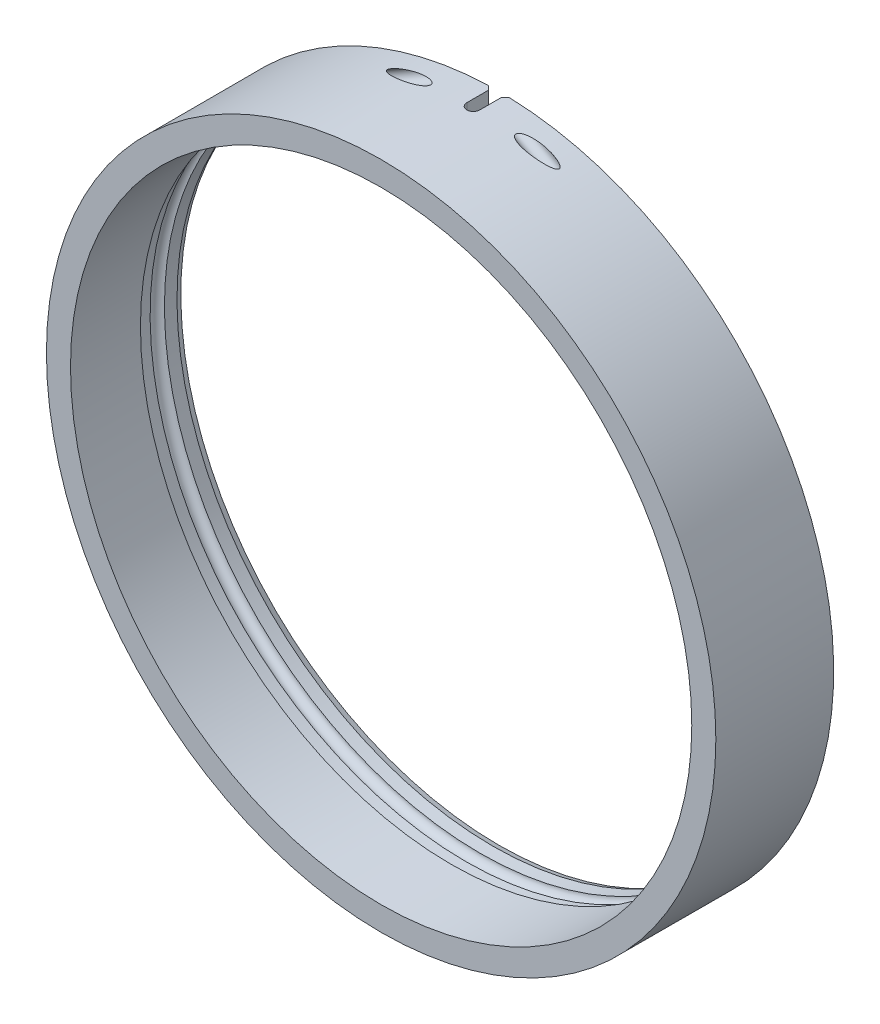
ISO-10303-21;
HEADER;
FILE_DESCRIPTION(('STEP AP214'),'2;1');
FILE_NAME('part.step','',(''),(''),'','','');
FILE_SCHEMA(('AUTOMOTIVE_DESIGN { 1 0 10303 214 1 1 1 1 }'));
ENDSEC;
DATA;
#1=APPLICATION_CONTEXT('core data for automotive mechanical design processes');
#2=APPLICATION_PROTOCOL_DEFINITION('international standard','automotive_design',2000,#1);
#3=PRODUCT_CONTEXT('',#1,'mechanical');
#4=PRODUCT('Part','Part','',(#3));
#5=PRODUCT_RELATED_PRODUCT_CATEGORY('part','',(#4));
#6=PRODUCT_DEFINITION_FORMATION('','',#4);
#7=PRODUCT_DEFINITION_CONTEXT('part definition',#1,'design');
#8=PRODUCT_DEFINITION('design','',#6,#7);
#9=PRODUCT_DEFINITION_SHAPE('','',#8);
#10=(LENGTH_UNIT() NAMED_UNIT(*) SI_UNIT(.MILLI.,.METRE.));
#11=(NAMED_UNIT(*) PLANE_ANGLE_UNIT() SI_UNIT($,.RADIAN.));
#12=(NAMED_UNIT(*) SI_UNIT($,.STERADIAN.) SOLID_ANGLE_UNIT());
#13=UNCERTAINTY_MEASURE_WITH_UNIT(LENGTH_MEASURE(1.E-05),#10,'distance_accuracy_value','');
#14=(GEOMETRIC_REPRESENTATION_CONTEXT(3) GLOBAL_UNCERTAINTY_ASSIGNED_CONTEXT((#13)) GLOBAL_UNIT_ASSIGNED_CONTEXT((#10,
#11,#12)) REPRESENTATION_CONTEXT('',''));
#15=CARTESIAN_POINT('',(0.,0.,0.));
#16=DIRECTION('',(0.,0.,1.));
#17=DIRECTION('',(1.,0.,0.));
#18=AXIS2_PLACEMENT_3D('',#15,#16,#17);
#19=CARTESIAN_POINT('',(0.,-0.0201261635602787,-51.));
#20=DIRECTION('',(0.,0.,-1.));
#21=DIRECTION('',(0.,1.,0.));
#22=AXIS2_PLACEMENT_3D('',#19,#20,#21);
#23=CYLINDRICAL_SURFACE('',#22,77.2050868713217);
#24=CARTESIAN_POINT('',(0.,-0.0201261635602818,-21.7138));
#25=DIRECTION('',(0.,0.,-1.));
#26=DIRECTION('',(-1.,0.,0.));
#27=AXIS2_PLACEMENT_3D('',#24,#25,#26);
#28=CIRCLE('',#27,77.2050868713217);
#29=CARTESIAN_POINT('',(-77.2050868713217,-0.0201261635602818,-21.7138));
#30=VERTEX_POINT('',#29);
#31=EDGE_CURVE('E413',#30,#30,#28,.F.);
#32=ORIENTED_EDGE('',*,*,#31,.T.);
#33=EDGE_LOOP('',(#32));
#34=FACE_BOUND('',#33,.T.);
#35=CARTESIAN_POINT('',(0.,-0.02012616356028,-39.1));
#36=DIRECTION('',(0.,0.,-1.));
#37=DIRECTION('',(0.,1.,0.));
#38=AXIS2_PLACEMENT_3D('',#35,#36,#37);
#39=CIRCLE('',#38,77.2050868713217);
#40=CARTESIAN_POINT('',(0.,77.1849607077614,-39.1));
#41=VERTEX_POINT('',#40);
#42=EDGE_CURVE('E411',#41,#41,#39,.T.);
#43=ORIENTED_EDGE('',*,*,#42,.T.);
#44=EDGE_LOOP('',(#43));
#45=FACE_BOUND('',#44,.T.);
#46=ADVANCED_FACE('F32',(#34,#45),#23,.F.);
#47=CARTESIAN_POINT('',(0.,0.,-39.1));
#48=DIRECTION('',(0.,0.,1.));
#49=DIRECTION('',(0.,-1.,0.));
#50=AXIS2_PLACEMENT_3D('',#47,#48,#49);
#51=PLANE('',#50);
#52=CARTESIAN_POINT('',(0.,0.,-39.1));
#53=DIRECTION('',(0.,0.,-1.));
#54=DIRECTION('',(0.,1.,0.));
#55=AXIS2_PLACEMENT_3D('',#52,#53,#54);
#56=CIRCLE('',#55,78.5253999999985);
#57=CARTESIAN_POINT('',(0.,78.5253999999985,-39.1));
#58=VERTEX_POINT('',#57);
#59=EDGE_CURVE('E409',#58,#58,#56,.T.);
#60=ORIENTED_EDGE('',*,*,#59,.T.);
#61=EDGE_LOOP('',(#60));
#62=FACE_BOUND('',#61,.T.);
#63=ORIENTED_EDGE('',*,*,#42,.F.);
#64=EDGE_LOOP('',(#63));
#65=FACE_BOUND('',#64,.T.);
#66=ADVANCED_FACE('F427',(#62,#65),#51,.F.);
#67=CARTESIAN_POINT('',(0.,0.,-51.));
#68=DIRECTION('',(0.,0.,-1.));
#69=DIRECTION('',(0.,1.,0.));
#70=AXIS2_PLACEMENT_3D('',#67,#68,#69);
#71=CYLINDRICAL_SURFACE('',#70,78.5253999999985);
#72=CARTESIAN_POINT('',(0.,0.,-42.82));
#73=DIRECTION('',(0.,0.,-1.));
#74=DIRECTION('',(0.,1.,0.));
#75=AXIS2_PLACEMENT_3D('',#72,#73,#74);
#76=CIRCLE('',#75,78.5253999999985);
#77=CARTESIAN_POINT('',(-39.2626999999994,68.0049912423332,-42.82));
#78=VERTEX_POINT('',#77);
#79=CARTESIAN_POINT('',(39.2626999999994,68.0049912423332,-42.82));
#80=VERTEX_POINT('',#79);
#81=EDGE_CURVE('E250',#78,#80,#76,.T.);
#82=ORIENTED_EDGE('',*,*,#81,.T.);
#83=CARTESIAN_POINT('',(0.,0.,-42.82));
#84=DIRECTION('',(0.,0.,-1.));
#85=DIRECTION('',(0.,1.,0.));
#86=AXIS2_PLACEMENT_3D('',#83,#84,#85);
#87=CIRCLE('',#86,78.5253999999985);
#88=EDGE_CURVE('E318',#80,#78,#87,.T.);
#89=ORIENTED_EDGE('',*,*,#88,.T.);
#90=EDGE_LOOP('',(#82,#89));
#91=FACE_BOUND('',#90,.T.);
#92=ORIENTED_EDGE('',*,*,#59,.F.);
#93=EDGE_LOOP('',(#92));
#94=FACE_BOUND('',#93,.T.);
#95=ADVANCED_FACE('F431',(#91,#94),#71,.F.);
#96=CARTESIAN_POINT('',(0.,0.,-44.6));
#97=DIRECTION('',(0.,0.,-1.));
#98=DIRECTION('',(0.,1.,0.));
#99=AXIS2_PLACEMENT_3D('',#96,#97,#98);
#100=TOROIDAL_SURFACE('',#99,78.5253999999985,1.77999999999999);
#101=CARTESIAN_POINT('',(0.,0.,-46.38));
#102=DIRECTION('',(0.,0.,-1.));
#103=DIRECTION('',(0.,1.,0.));
#104=AXIS2_PLACEMENT_3D('',#101,#102,#103);
#105=CIRCLE('',#104,78.5253999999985);
#106=CARTESIAN_POINT('',(39.2626999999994,68.0049912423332,-46.38));
#107=VERTEX_POINT('',#106);
#108=CARTESIAN_POINT('',(-39.2626999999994,68.0049912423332,-46.38));
#109=VERTEX_POINT('',#108);
#110=EDGE_CURVE('E97',#107,#109,#105,.T.);
#111=ORIENTED_EDGE('',*,*,#110,.T.);
#112=CARTESIAN_POINT('',(-39.2626999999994,68.0049912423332,-44.6));
#113=DIRECTION('',(-0.866025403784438,-0.500000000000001,0.));
#114=DIRECTION('',(0.500000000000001,-0.866025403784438,0.));
#115=AXIS2_PLACEMENT_3D('',#112,#113,#114);
#116=CIRCLE('',#115,1.78);
#117=EDGE_CURVE('E257',#109,#78,#116,.F.);
#118=ORIENTED_EDGE('',*,*,#117,.T.);
#119=ORIENTED_EDGE('',*,*,#88,.F.);
#120=CARTESIAN_POINT('',(39.2626999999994,68.0049912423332,-44.6));
#121=DIRECTION('',(0.866025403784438,-0.500000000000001,0.));
#122=DIRECTION('',(0.500000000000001,0.866025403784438,0.));
#123=AXIS2_PLACEMENT_3D('',#120,#121,#122);
#124=CIRCLE('',#123,1.78000000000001);
#125=EDGE_CURVE('E254',#80,#107,#124,.F.);
#126=ORIENTED_EDGE('',*,*,#125,.T.);
#127=EDGE_LOOP('',(#111,#118,#119,#126));
#128=FACE_BOUND('',#127,.T.);
#129=ADVANCED_FACE('F316',(#128),#100,.F.);
#130=CARTESIAN_POINT('',(0.,0.,-44.6));
#131=DIRECTION('',(0.,0.,-1.));
#132=DIRECTION('',(0.,1.,0.));
#133=AXIS2_PLACEMENT_3D('',#130,#131,#132);
#134=TOROIDAL_SURFACE('',#133,78.5253999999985,1.77999999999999);
#135=ORIENTED_EDGE('',*,*,#81,.F.);
#136=CARTESIAN_POINT('',(-39.2626999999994,68.0049912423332,-42.82));
#137=CARTESIAN_POINT('',(-39.0251412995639,68.1417544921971,-42.820002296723));
#138=CARTESIAN_POINT('',(-38.7873193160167,68.278061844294,-42.8200000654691));
#139=CARTESIAN_POINT('',(-38.3023144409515,68.5546140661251,-42.8200014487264));
#140=CARTESIAN_POINT('',(-38.0551089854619,68.6948193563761,-42.8200052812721));
#141=CARTESIAN_POINT('',(-37.5511561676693,68.9788988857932,-42.8200363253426));
#142=CARTESIAN_POINT('',(-37.2943822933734,69.1227261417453,-42.8200643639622));
#143=CARTESIAN_POINT('',(-36.9052486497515,69.3391463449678,-42.8201502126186));
#144=CARTESIAN_POINT('',(-36.7732080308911,69.4123135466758,-42.8201868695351));
#145=CARTESIAN_POINT('',(-36.5153802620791,69.5546688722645,-42.8202786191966));
#146=CARTESIAN_POINT('',(-36.3896037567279,69.623876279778,-42.8203327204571));
#147=CARTESIAN_POINT('',(-36.0121743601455,69.8308871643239,-42.8205322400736));
#148=CARTESIAN_POINT('',(-35.7602409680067,69.9681796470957,-42.8207148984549));
#149=CARTESIAN_POINT('',(-35.2558478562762,70.2412587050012,-42.8212349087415));
#150=CARTESIAN_POINT('',(-35.0033887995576,70.377046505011,-42.8215721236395));
#151=CARTESIAN_POINT('',(-34.4979367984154,70.6471377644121,-42.8224701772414));
#152=CARTESIAN_POINT('',(-34.2449444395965,70.7814423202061,-42.8230308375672));
#153=CARTESIAN_POINT('',(-33.7325160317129,71.0516610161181,-42.8244715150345));
#154=CARTESIAN_POINT('',(-33.4730631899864,71.1875432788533,-42.825358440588));
#155=CARTESIAN_POINT('',(-32.9552577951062,71.4568769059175,-42.8275416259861));
#156=CARTESIAN_POINT('',(-32.6969106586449,71.5903387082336,-42.8288349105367));
#157=CARTESIAN_POINT('',(-32.1813320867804,71.8548904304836,-42.8319371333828));
#158=CARTESIAN_POINT('',(-31.9241058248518,71.985990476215,-42.8337423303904));
#159=CARTESIAN_POINT('',(-31.4107781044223,72.2458644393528,-42.83798547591));
#160=CARTESIAN_POINT('',(-31.1546816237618,72.3746482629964,-42.8404188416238));
#161=CARTESIAN_POINT('',(-30.6436203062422,72.6299289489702,-42.8460466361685));
#162=CARTESIAN_POINT('',(-30.3886602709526,72.7564355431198,-42.8492355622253));
#163=CARTESIAN_POINT('',(-29.8798738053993,73.0071878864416,-42.8565122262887));
#164=CARTESIAN_POINT('',(-29.6260520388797,73.1314432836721,-42.8605934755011));
#165=CARTESIAN_POINT('',(-29.1195446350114,73.3777155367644,-42.8698050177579));
#166=CARTESIAN_POINT('',(-28.8668635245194,73.499741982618,-42.8749277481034));
#167=CARTESIAN_POINT('',(-28.3292101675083,73.7575549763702,-42.8871281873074));
#168=CARTESIAN_POINT('',(-28.0441515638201,73.8931538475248,-42.894370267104));
#169=CARTESIAN_POINT('',(-27.4820424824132,74.1584457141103,-42.9104817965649));
#170=CARTESIAN_POINT('',(-27.2050155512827,74.2881920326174,-42.9192943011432));
#171=CARTESIAN_POINT('',(-26.6590891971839,74.5419858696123,-42.9387250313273));
#172=CARTESIAN_POINT('',(-26.3902107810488,74.6660835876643,-42.9492770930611));
#173=CARTESIAN_POINT('',(-25.8606860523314,74.9087484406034,-42.9723631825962));
#174=CARTESIAN_POINT('',(-25.6000584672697,75.0273636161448,-42.984821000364));
#175=CARTESIAN_POINT('',(-25.0871307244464,75.2592007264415,-43.0118936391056));
#176=CARTESIAN_POINT('',(-24.8348471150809,75.3724693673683,-43.0264212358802));
#177=CARTESIAN_POINT('',(-24.3386950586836,75.5937216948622,-43.0578067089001));
#178=CARTESIAN_POINT('',(-24.0948410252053,75.7017516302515,-43.0745652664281));
#179=CARTESIAN_POINT('',(-23.6156210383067,75.9125814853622,-43.1105702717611));
#180=CARTESIAN_POINT('',(-23.3802676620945,76.0154290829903,-43.129704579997));
#181=CARTESIAN_POINT('',(-22.8525698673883,76.2444311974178,-43.1764468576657));
#182=CARTESIAN_POINT('',(-22.5601526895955,76.3702326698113,-43.2049857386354));
#183=CARTESIAN_POINT('',(-21.9994707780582,76.6095074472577,-43.2663242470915));
#184=CARTESIAN_POINT('',(-21.7312137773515,76.7231380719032,-43.2985743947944));
#185=CARTESIAN_POINT('',(-21.2191720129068,76.9384385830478,-43.3674260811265));
#186=CARTESIAN_POINT('',(-20.975365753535,77.0402616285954,-43.4033713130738));
#187=CARTESIAN_POINT('',(-20.619221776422,77.1879674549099,-43.462130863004));
#188=CARTESIAN_POINT('',(-20.5066129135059,77.234518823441,-43.481626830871));
#189=CARTESIAN_POINT('',(-20.2467538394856,77.3415849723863,-43.5291225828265));
#190=CARTESIAN_POINT('',(-20.099583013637,77.4019563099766,-43.5578853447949));
#191=CARTESIAN_POINT('',(-19.7877196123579,77.5293571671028,-43.6239189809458));
#192=CARTESIAN_POINT('',(-19.6231116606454,77.5962864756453,-43.6618021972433));
#193=CARTESIAN_POINT('',(-19.385037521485,77.6926401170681,-43.7229131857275));
#194=CARTESIAN_POINT('',(-19.3109278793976,77.7225703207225,-43.7428348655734));
#195=CARTESIAN_POINT('',(-19.1681954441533,77.7800938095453,-43.7833466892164));
#196=CARTESIAN_POINT('',(-19.099542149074,77.8077076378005,-43.8037993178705));
#197=CARTESIAN_POINT('',(-18.9541555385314,77.8660612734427,-43.8496275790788));
#198=CARTESIAN_POINT('',(-18.8774962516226,77.89675565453,-43.8752987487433));
#199=CARTESIAN_POINT('',(-18.732836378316,77.9545401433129,-43.9275465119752));
#200=CARTESIAN_POINT('',(-18.6647348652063,77.9816843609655,-43.9537773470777));
#201=CARTESIAN_POINT('',(-18.5664011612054,78.0208016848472,-43.9949675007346));
#202=CARTESIAN_POINT('',(-18.5356123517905,78.0330382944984,-44.0083480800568));
#203=CARTESIAN_POINT('',(-18.4762122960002,78.0566254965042,-44.0352917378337));
#204=CARTESIAN_POINT('',(-18.4475793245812,78.0679859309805,-44.0487979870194));
#205=CARTESIAN_POINT('',(-18.3924979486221,78.0898230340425,-44.075988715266));
#206=CARTESIAN_POINT('',(-18.3660235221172,78.1003110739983,-44.0896111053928));
#207=CARTESIAN_POINT('',(-18.3152654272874,78.1204054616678,-44.1170330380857));
#208=CARTESIAN_POINT('',(-18.2909505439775,78.1300250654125,-44.1307645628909));
#209=CARTESIAN_POINT('',(-18.2518136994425,78.1454994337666,-44.1540635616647));
#210=CARTESIAN_POINT('',(-18.236815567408,78.1514273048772,-44.1632865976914));
#211=CARTESIAN_POINT('',(-18.2077948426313,78.1628934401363,-44.1817996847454));
#212=CARTESIAN_POINT('',(-18.1937594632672,78.1684369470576,-44.191066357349));
#213=CARTESIAN_POINT('',(-18.1666665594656,78.1791344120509,-44.2096654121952));
#214=CARTESIAN_POINT('',(-18.1535944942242,78.1842942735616,-44.2189731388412));
#215=CARTESIAN_POINT('',(-18.128430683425,78.1942243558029,-44.2376534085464));
#216=CARTESIAN_POINT('',(-18.1163224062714,78.1990012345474,-44.2470000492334));
#217=CARTESIAN_POINT('',(-18.0930887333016,78.2081651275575,-44.2657571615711));
#218=CARTESIAN_POINT('',(-18.0819445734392,78.2125596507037,-44.2751406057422));
#219=CARTESIAN_POINT('',(-18.0606422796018,78.22095828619,-44.2939698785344));
#220=CARTESIAN_POINT('',(-18.0504628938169,78.2249708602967,-44.303387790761));
#221=CARTESIAN_POINT('',(-18.0310921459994,78.2326054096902,-44.3222854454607));
#222=CARTESIAN_POINT('',(-18.0218769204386,78.2362368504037,-44.3317366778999));
#223=CARTESIAN_POINT('',(-18.0086273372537,78.2414575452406,-44.3461440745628));
#224=CARTESIAN_POINT('',(-18.0043889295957,78.2431275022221,-44.3508842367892));
#225=CARTESIAN_POINT('',(-17.9961573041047,78.2463706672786,-44.360375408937));
#226=CARTESIAN_POINT('',(-17.9921605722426,78.2479452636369,-44.3651228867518));
#227=CARTESIAN_POINT('',(-17.9844125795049,78.2509976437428,-44.3746281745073));
#228=CARTESIAN_POINT('',(-17.9806576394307,78.2524768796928,-44.3793825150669));
#229=CARTESIAN_POINT('',(-17.9733934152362,78.2553385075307,-44.3889012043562));
#230=CARTESIAN_POINT('',(-17.9698803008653,78.256722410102,-44.3936621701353));
#231=CARTESIAN_POINT('',(-17.963099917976,78.2593933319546,-44.4031936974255));
#232=CARTESIAN_POINT('',(-17.959828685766,78.2606819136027,-44.4079609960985));
#233=CARTESIAN_POINT('',(-17.953532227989,78.2631621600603,-44.4175047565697));
#234=CARTESIAN_POINT('',(-17.9505029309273,78.2643554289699,-44.4222781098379));
#235=CARTESIAN_POINT('',(-17.9446904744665,78.2666450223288,-44.4318335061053));
#236=CARTESIAN_POINT('',(-17.9419031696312,78.2677429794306,-44.4366126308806));
#237=CARTESIAN_POINT('',(-17.9365747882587,78.2698419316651,-44.4461790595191));
#238=CARTESIAN_POINT('',(-17.9340295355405,78.2708445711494,-44.4509636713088));
#239=CARTESIAN_POINT('',(-17.929185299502,78.2727528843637,-44.4605405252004));
#240=CARTESIAN_POINT('',(-17.9268821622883,78.2736601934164,-44.4653303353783));
#241=CARTESIAN_POINT('',(-17.9225221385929,78.2753778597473,-44.4749170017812));
#242=CARTESIAN_POINT('',(-17.9204611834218,78.2761898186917,-44.4797117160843));
#243=CARTESIAN_POINT('',(-17.9165854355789,78.2777168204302,-44.4893075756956));
#244=CARTESIAN_POINT('',(-17.9147667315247,78.2784334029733,-44.4941068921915));
#245=CARTESIAN_POINT('',(-17.91137531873,78.2797697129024,-44.5037113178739));
#246=CARTESIAN_POINT('',(-17.9097989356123,78.2803908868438,-44.5085149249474));
#247=CARTESIAN_POINT('',(-17.9068919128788,78.2815364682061,-44.5181272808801));
#248=CARTESIAN_POINT('',(-17.905557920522,78.2820621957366,-44.5229348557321));
#249=CARTESIAN_POINT('',(-17.9031353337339,78.2830170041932,-44.532554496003));
#250=CARTESIAN_POINT('',(-17.9020437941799,78.2834472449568,-44.5373657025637));
#251=CARTESIAN_POINT('',(-17.9001056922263,78.2842112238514,-44.5469919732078));
#252=CARTESIAN_POINT('',(-17.8992566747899,78.2845459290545,-44.5518064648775));
#253=CARTESIAN_POINT('',(-17.8978030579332,78.2851190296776,-44.5614386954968));
#254=CARTESIAN_POINT('',(-17.8971965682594,78.2853581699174,-44.5662561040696));
#255=CARTESIAN_POINT('',(-17.8962275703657,78.2857402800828,-44.5758936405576));
#256=CARTESIAN_POINT('',(-17.8958637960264,78.2858837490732,-44.5807136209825));
#257=CARTESIAN_POINT('',(-17.8953790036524,78.286074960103,-44.5903557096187));
#258=CARTESIAN_POINT('',(-17.8952573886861,78.2861229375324,-44.5951777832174));
#259=CARTESIAN_POINT('',(-17.8952578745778,78.2861227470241,-44.6));
#260=B_SPLINE_CURVE_WITH_KNOTS('',3,(#136,#137,#138,#139,#140,#141,#142,#143,#144,#145,#146,
#147,#148,#149,#150,#151,#152,#153,#154,#155,#156,#157,#158,#159,#160,#161,#162,#163,#164,#165,
#166,#167,#168,#169,#170,#171,#172,#173,#174,#175,#176,#177,#178,#179,#180,#181,#182,#183,#184,
#185,#186,#187,#188,#189,#190,#191,#192,#193,#194,#195,#196,#197,#198,#199,#200,#201,#202,#203,
#204,#205,#206,#207,#208,#209,#210,#211,#212,#213,#214,#215,#216,#217,#218,#219,#220,#221,#222,
#223,#224,#225,#226,#227,#228,#229,#230,#231,#232,#233,#234,#235,#236,#237,#238,#239,#240,#241,
#242,#243,#244,#245,#246,#247,#248,#249,#250,#251,#252,#253,#254,#255,#256,#257,#258,#259),
.UNSPECIFIED.,.F.,.F.,(4,2,2,2,2,2,2,2,2,2,2,2,2,2,2,2,2,2,2,2,2,2,2,2,2,2,2,2,2,2,2,2,2,2,2,2,
2,2,2,2,2,2,2,2,2,2,2,2,2,2,2,2,2,2,2,2,2,2,2,2,2,4),(0.,0.822341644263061,1.67493024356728,
2.55785846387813,3.01073028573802,3.44140901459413,4.30214661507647,5.1621226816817,
6.02141359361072,6.90005817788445,7.77241376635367,8.63855120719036,9.49854004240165,
10.3524482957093,11.2003422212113,12.042286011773,12.9895243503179,13.9076096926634,
14.7965657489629,15.6564141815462,16.4871753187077,17.2888690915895,18.0615162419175,
19.0202689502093,19.8995268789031,20.6993527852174,21.0695415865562,21.5544519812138,
22.0993484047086,22.3464384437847,22.5767306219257,22.8360937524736,23.0695848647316,
23.176765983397,23.2776548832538,23.3723367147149,23.4609155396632,23.5166422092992,
23.5697583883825,23.620316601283,23.6683779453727,23.7140137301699,23.7573074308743,
23.798356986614,23.8180775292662,23.8372818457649,23.8559874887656,23.8742134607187,
23.8919803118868,23.9093102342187,23.9262271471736,23.9427567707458,23.9589266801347,
23.9747663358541,23.990307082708,24.0055821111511,24.0206263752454,24.035476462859,
24.0501704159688,24.0647475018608,24.0792479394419,24.0937125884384),.UNSPECIFIED.);
#261=CARTESIAN_POINT('',(-17.8952578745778,78.2861227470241,-44.6));
#262=VERTEX_POINT('',#261);
#263=EDGE_CURVE('E255',#78,#262,#260,.T.);
#264=ORIENTED_EDGE('',*,*,#263,.T.);
#265=CARTESIAN_POINT('',(-17.8952578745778,78.2861227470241,-44.6));
#266=CARTESIAN_POINT('',(-17.8952573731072,78.2861229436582,-44.6048617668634));
#267=CARTESIAN_POINT('',(-17.8953809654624,78.2860741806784,-44.6097233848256));
#268=CARTESIAN_POINT('',(-17.8958736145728,78.2858798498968,-44.6194445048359));
#269=CARTESIAN_POINT('',(-17.8962432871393,78.285734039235,-44.624303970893));
#270=CARTESIAN_POINT('',(-17.8972279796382,78.285345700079,-44.6340204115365));
#271=CARTESIAN_POINT('',(-17.8978443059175,78.2851026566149,-44.6388772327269));
#272=CARTESIAN_POINT('',(-17.8993214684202,78.2845202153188,-44.6485882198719));
#273=CARTESIAN_POINT('',(-17.9001842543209,78.2841800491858,-44.6534420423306));
#274=CARTESIAN_POINT('',(-17.9021537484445,78.283403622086,-44.6631469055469));
#275=CARTESIAN_POINT('',(-17.9032629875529,78.2829663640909,-44.6679973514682));
#276=CARTESIAN_POINT('',(-17.9057248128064,78.2819960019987,-44.6776954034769));
#277=CARTESIAN_POINT('',(-17.9070804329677,78.2814617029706,-44.6825421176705));
#278=CARTESIAN_POINT('',(-17.9100345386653,78.2802974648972,-44.6922326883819));
#279=CARTESIAN_POINT('',(-17.9116364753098,78.2796661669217,-44.6970753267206));
#280=CARTESIAN_POINT('',(-17.9150828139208,78.2783080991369,-44.706757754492));
#281=CARTESIAN_POINT('',(-17.9169309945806,78.2775798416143,-44.7115959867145));
#282=CARTESIAN_POINT('',(-17.9208695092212,78.2760279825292,-44.7212696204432));
#283=CARTESIAN_POINT('',(-17.9229638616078,78.2752027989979,-44.7261031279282));
#284=CARTESIAN_POINT('',(-17.9273944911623,78.2734571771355,-44.7357673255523));
#285=CARTESIAN_POINT('',(-17.9297349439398,78.2725350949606,-44.740595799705));
#286=CARTESIAN_POINT('',(-17.9346576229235,78.2705957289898,-44.7502499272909));
#287=CARTESIAN_POINT('',(-17.937244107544,78.2695767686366,-44.7550730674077));
#288=CARTESIAN_POINT('',(-17.9426587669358,78.2674436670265,-44.7647164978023));
#289=CARTESIAN_POINT('',(-17.9454912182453,78.2663278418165,-44.7695340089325));
#290=CARTESIAN_POINT('',(-17.95139778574,78.2640010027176,-44.7791661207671));
#291=CARTESIAN_POINT('',(-17.9544761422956,78.2627883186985,-44.7839777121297));
#292=CARTESIAN_POINT('',(-17.9608745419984,78.2602677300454,-44.793597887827));
#293=CARTESIAN_POINT('',(-17.9641987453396,78.258958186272,-44.7984032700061));
#294=CARTESIAN_POINT('',(-17.9710888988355,78.2562438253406,-44.8080108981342));
#295=CARTESIAN_POINT('',(-17.974658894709,78.2548374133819,-44.8128097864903));
#296=CARTESIAN_POINT('',(-17.9820407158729,78.251929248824,-44.8224042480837));
#297=CARTESIAN_POINT('',(-17.9858564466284,78.2504259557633,-44.82719634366));
#298=CARTESIAN_POINT('',(-17.9937298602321,78.2473239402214,-44.836777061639));
#299=CARTESIAN_POINT('',(-17.9977912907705,78.2457237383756,-44.8415621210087));
#300=CARTESIAN_POINT('',(-18.0061561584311,78.2424278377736,-44.8511283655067));
#301=CARTESIAN_POINT('',(-18.0104631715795,78.2407307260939,-44.8559059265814));
#302=CARTESIAN_POINT('',(-18.0239286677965,78.2354245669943,-44.8704284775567));
#303=CARTESIAN_POINT('',(-18.0332930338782,78.2317340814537,-44.8799537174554));
#304=CARTESIAN_POINT('',(-18.0529772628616,78.2239753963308,-44.8989992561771));
#305=CARTESIAN_POINT('',(-18.0633213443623,78.2198975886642,-44.9084903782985));
#306=CARTESIAN_POINT('',(-18.0849683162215,78.2113623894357,-44.9274658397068));
#307=CARTESIAN_POINT('',(-18.0962927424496,78.2068964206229,-44.9369216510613));
#308=CARTESIAN_POINT('',(-18.1199022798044,78.1975835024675,-44.9558231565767));
#309=CARTESIAN_POINT('',(-18.1322063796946,78.1927289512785,-44.9652412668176));
#310=CARTESIAN_POINT('',(-18.1577772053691,78.1826373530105,-44.984064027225));
#311=CARTESIAN_POINT('',(-18.1710606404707,78.1773935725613,-44.9934422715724));
#312=CARTESIAN_POINT('',(-18.1985916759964,78.1665220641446,-45.0121818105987));
#313=CARTESIAN_POINT('',(-18.2128539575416,78.1608883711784,-45.0215179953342));
#314=CARTESIAN_POINT('',(-18.2423438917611,78.1492356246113,-45.0401694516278));
#315=CARTESIAN_POINT('',(-18.2575844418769,78.1432112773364,-45.0494609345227));
#316=CARTESIAN_POINT('',(-18.2973557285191,78.127484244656,-45.0729332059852));
#317=CARTESIAN_POINT('',(-18.3220633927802,78.1177080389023,-45.0867649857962));
#318=CARTESIAN_POINT('',(-18.3736415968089,78.0972862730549,-45.1143858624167));
#319=CARTESIAN_POINT('',(-18.4005435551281,78.0866273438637,-45.1281058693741));
#320=CARTESIAN_POINT('',(-18.456514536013,78.0644341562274,-45.1554899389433));
#321=CARTESIAN_POINT('',(-18.4856097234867,78.0528884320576,-45.1690909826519));
#322=CARTESIAN_POINT('',(-18.545968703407,78.0289162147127,-45.1962220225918));
#323=CARTESIAN_POINT('',(-18.5772543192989,78.016479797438,-45.2096943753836));
#324=CARTESIAN_POINT('',(-18.677181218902,77.9767206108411,-45.2511668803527));
#325=CARTESIAN_POINT('',(-18.7463799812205,77.9491326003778,-45.277569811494));
#326=CARTESIAN_POINT('',(-18.8933710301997,77.8904013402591,-45.3301527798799));
#327=CARTESIAN_POINT('',(-18.9712644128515,77.8592034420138,-45.3559825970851));
#328=CARTESIAN_POINT('',(-19.1179863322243,77.8002937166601,-45.4017723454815));
#329=CARTESIAN_POINT('',(-19.1867331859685,77.7726326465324,-45.4220625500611));
#330=CARTESIAN_POINT('',(-19.3295808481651,77.7150423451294,-45.4622479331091));
#331=CARTESIAN_POINT('',(-19.4037109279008,77.6850931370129,-45.4820096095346));
#332=CARTESIAN_POINT('',(-19.6416431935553,77.5887621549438,-45.5425991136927));
#333=CARTESIAN_POINT('',(-19.8060703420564,77.5218822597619,-45.5801795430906));
#334=CARTESIAN_POINT('',(-20.1174008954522,77.3946545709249,-45.6456783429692));
#335=CARTESIAN_POINT('',(-20.2642209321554,77.3344068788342,-45.6742063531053));
#336=CARTESIAN_POINT('',(-20.5235324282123,77.2275320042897,-45.7213463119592));
#337=CARTESIAN_POINT('',(-20.635946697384,77.1810465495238,-45.7407094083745));
#338=CARTESIAN_POINT('',(-20.9913102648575,77.0336189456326,-45.7990543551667));
#339=CARTESIAN_POINT('',(-21.2345233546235,76.9320136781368,-45.8347599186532));
#340=CARTESIAN_POINT('',(-21.7451134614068,76.7172635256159,-45.903148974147));
#341=CARTESIAN_POINT('',(-22.0125110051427,76.6039677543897,-45.9351884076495));
#342=CARTESIAN_POINT('',(-22.5712120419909,76.3654830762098,-45.9961270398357));
#343=CARTESIAN_POINT('',(-22.8625075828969,76.2401392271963,-46.0244864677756));
#344=CARTESIAN_POINT('',(-23.3889405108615,76.0116490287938,-46.0710188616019));
#345=CARTESIAN_POINT('',(-23.6241494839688,75.9088486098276,-46.0901025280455));
#346=CARTESIAN_POINT('',(-24.1030466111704,75.6981289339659,-46.1260120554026));
#347=CARTESIAN_POINT('',(-24.3467222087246,75.5901622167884,-46.1427265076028));
#348=CARTESIAN_POINT('',(-24.8424837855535,75.3690525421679,-46.17402930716));
#349=CARTESIAN_POINT('',(-25.0945553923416,75.2558635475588,-46.1885189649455));
#350=CARTESIAN_POINT('',(-25.6070259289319,75.0242024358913,-46.2155210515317));
#351=CARTESIAN_POINT('',(-25.8674083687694,74.9056838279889,-46.227946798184));
#352=CARTESIAN_POINT('',(-26.3964100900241,74.6632294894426,-46.2509737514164));
#353=CARTESIAN_POINT('',(-26.6650107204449,74.5392459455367,-46.2614992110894));
#354=CARTESIAN_POINT('',(-27.2103493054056,74.285698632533,-46.2808813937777));
#355=CARTESIAN_POINT('',(-27.4870663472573,74.1560849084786,-46.2896723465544));
#356=CARTESIAN_POINT('',(-28.0485240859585,73.8910774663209,-46.3057450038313));
#357=CARTESIAN_POINT('',(-28.3332413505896,73.7556306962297,-46.3129700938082));
#358=CARTESIAN_POINT('',(-28.870374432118,73.4980503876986,-46.3251458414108));
#359=CARTESIAN_POINT('',(-29.1228760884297,73.3761033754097,-46.3302597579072));
#360=CARTESIAN_POINT('',(-29.6290190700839,73.1299947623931,-46.3394558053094));
#361=CARTESIAN_POINT('',(-29.8826558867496,73.0058236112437,-46.3435304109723));
#362=CARTESIAN_POINT('',(-30.391067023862,72.7552447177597,-46.3507955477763));
#363=CARTESIAN_POINT('',(-30.6458366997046,72.6288273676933,-46.3539796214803));
#364=CARTESIAN_POINT('',(-31.1565119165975,72.3737302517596,-46.3595991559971));
#365=CARTESIAN_POINT('',(-31.4124126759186,72.2450407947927,-46.3620291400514));
#366=CARTESIAN_POINT('',(-31.925343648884,71.985360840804,-46.3662666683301));
#367=CARTESIAN_POINT('',(-32.1823689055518,71.8543604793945,-46.368069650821));
#368=CARTESIAN_POINT('',(-32.6975402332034,71.5900135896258,-46.3711683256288));
#369=CARTESIAN_POINT('',(-32.9556811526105,71.4566569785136,-46.372460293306));
#370=CARTESIAN_POINT('',(-33.473069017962,71.1875395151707,-46.3746414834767));
#371=CARTESIAN_POINT('',(-33.7323105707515,71.0517682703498,-46.3755277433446));
#372=CARTESIAN_POINT('',(-34.2443770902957,70.7817425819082,-46.376967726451));
#373=CARTESIAN_POINT('',(-34.4972186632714,70.6475196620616,-46.3775282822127));
#374=CARTESIAN_POINT('',(-35.0023609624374,70.3775979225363,-46.3784262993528));
#375=CARTESIAN_POINT('',(-35.254661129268,70.2418980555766,-46.3787635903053));
#376=CARTESIAN_POINT('',(-35.75872850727,69.9690014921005,-46.3792838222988));
#377=CARTESIAN_POINT('',(-36.0104950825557,69.8318036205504,-46.3794666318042));
#378=CARTESIAN_POINT('',(-36.3876717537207,69.6249380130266,-46.3796663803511));
#379=CARTESIAN_POINT('',(-36.5133619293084,69.5557805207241,-46.3797205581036));
#380=CARTESIAN_POINT('',(-36.7712084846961,69.4134201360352,-46.3798125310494));
#381=CARTESIAN_POINT('',(-36.9033539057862,69.3401973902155,-46.3798493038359));
#382=CARTESIAN_POINT('',(-37.2927977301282,69.1236114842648,-46.3799354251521));
#383=CARTESIAN_POINT('',(-37.549776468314,68.9796731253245,-46.379963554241));
#384=CARTESIAN_POINT('',(-38.0541329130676,68.6953716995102,-46.3799946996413));
#385=CARTESIAN_POINT('',(-38.301537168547,68.5550556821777,-46.3799985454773));
#386=CARTESIAN_POINT('',(-38.786933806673,68.2782826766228,-46.3799999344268));
#387=CARTESIAN_POINT('',(-39.0249487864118,68.1418653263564,-46.3799976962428));
#388=CARTESIAN_POINT('',(-39.2626999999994,68.0049912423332,-46.38));
#389=B_SPLINE_CURVE_WITH_KNOTS('',3,(#265,#266,#267,#268,#269,#270,#271,#272,#273,#274,#275,
#276,#277,#278,#279,#280,#281,#282,#283,#284,#285,#286,#287,#288,#289,#290,#291,#292,#293,#294,
#295,#296,#297,#298,#299,#300,#301,#302,#303,#304,#305,#306,#307,#308,#309,#310,#311,#312,#313,
#314,#315,#316,#317,#318,#319,#320,#321,#322,#323,#324,#325,#326,#327,#328,#329,#330,#331,#332,
#333,#334,#335,#336,#337,#338,#339,#340,#341,#342,#343,#344,#345,#346,#347,#348,#349,#350,#351,
#352,#353,#354,#355,#356,#357,#358,#359,#360,#361,#362,#363,#364,#365,#366,#367,#368,#369,#370,
#371,#372,#373,#374,#375,#376,#377,#378,#379,#380,#381,#382,#383,#384,#385,#386,#387,#388),
.UNSPECIFIED.,.F.,.F.,(4,2,2,2,2,2,2,2,2,2,2,2,2,2,2,2,2,2,2,2,2,2,2,2,2,2,2,2,2,2,2,2,2,2,2,2,
2,2,2,2,2,2,2,2,2,2,2,2,2,2,2,2,2,2,2,2,2,2,2,2,2,4),(0.,0.0145832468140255,0.0292031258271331,
0.0439014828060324,0.0587194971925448,0.0736973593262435,0.0888739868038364,0.104286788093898,
0.119971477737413,0.135961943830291,0.152290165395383,0.168986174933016,0.186078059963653,
0.203591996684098,0.221552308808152,0.239981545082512,0.258900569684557,0.278328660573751,
0.298283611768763,0.339834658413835,0.383674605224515,0.429902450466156,0.478602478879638,
0.529846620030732,0.583696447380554,0.640204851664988,0.730047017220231,0.82610170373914,
0.928473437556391,1.03724767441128,1.27425647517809,1.53757980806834,1.76804589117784,
2.01509689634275,2.5592634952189,3.04295323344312,3.41247220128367,4.21032716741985,
5.08676768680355,6.04185445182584,6.81403800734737,7.61515847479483,8.44523657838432,
9.30429227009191,10.1923459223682,11.1094192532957,12.0555360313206,12.8968910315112,
13.7441752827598,14.5974528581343,15.4567898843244,16.3222542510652,17.1939153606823,
18.0718439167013,18.9306204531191,19.7900517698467,20.6502141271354,21.0805937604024,
21.5338213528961,22.4174486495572,23.2707198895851,24.0937279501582),.UNSPECIFIED.);
#390=EDGE_CURVE('E93',#262,#109,#389,.T.);
#391=ORIENTED_EDGE('',*,*,#390,.T.);
#392=CARTESIAN_POINT('',(0.,0.,-46.38));
#393=DIRECTION('',(0.,0.,-1.));
#394=DIRECTION('',(0.,1.,0.));
#395=AXIS2_PLACEMENT_3D('',#392,#393,#394);
#396=CIRCLE('',#395,78.5253999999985);
#397=CARTESIAN_POINT('',(-1.5875,78.509351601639,-46.38));
#398=VERTEX_POINT('',#397);
#399=EDGE_CURVE('E83',#109,#398,#396,.T.);
#400=ORIENTED_EDGE('',*,*,#399,.T.);
#401=CARTESIAN_POINT('',(-1.5875,80.289707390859,-44.6000000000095));
#402=CARTESIAN_POINT('',(-1.5875,80.289707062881,-44.6500727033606));
#403=CARTESIAN_POINT('',(-1.5875,80.2875927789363,-44.7001214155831));
#404=CARTESIAN_POINT('',(-1.5875,80.279158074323,-44.799860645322));
#405=CARTESIAN_POINT('',(-1.5875,80.2728378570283,-44.8495511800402));
#406=CARTESIAN_POINT('',(-1.58749999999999,80.2476284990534,-44.9974641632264));
#407=CARTESIAN_POINT('',(-1.58749999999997,80.2224904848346,-45.0946957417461));
#408=CARTESIAN_POINT('',(-1.58749999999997,80.1562486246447,-45.2835556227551));
#409=CARTESIAN_POINT('',(-1.58749999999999,80.1151371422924,-45.3751812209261));
#410=CARTESIAN_POINT('',(-1.58750000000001,80.0181205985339,-45.55022816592));
#411=CARTESIAN_POINT('',(-1.58750000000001,79.9622181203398,-45.6336509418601));
#412=CARTESIAN_POINT('',(-1.5875,79.8372011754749,-45.7899324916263));
#413=CARTESIAN_POINT('',(-1.5875,79.7680857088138,-45.8627904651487));
#414=CARTESIAN_POINT('',(-1.5875,79.6185896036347,-45.9958869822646));
#415=CARTESIAN_POINT('',(-1.58750000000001,79.5382067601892,-46.056123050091));
#416=CARTESIAN_POINT('',(-1.58750000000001,79.3684478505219,-46.1622670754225));
#417=CARTESIAN_POINT('',(-1.5875,79.2790683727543,-46.208169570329));
#418=CARTESIAN_POINT('',(-1.5875,79.0938900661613,-46.2842969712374));
#419=CARTESIAN_POINT('',(-1.58750000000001,78.9980950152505,-46.3145310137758));
#420=CARTESIAN_POINT('',(-1.58750000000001,78.8363217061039,-46.3509624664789));
#421=CARTESIAN_POINT('',(-1.5875,78.7713598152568,-46.3618449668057));
#422=CARTESIAN_POINT('',(-1.5875,78.6407248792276,-46.3763627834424));
#423=CARTESIAN_POINT('',(-1.5875,78.575052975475,-46.3800083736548));
#424=CARTESIAN_POINT('',(-1.58750000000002,78.509351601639,-46.38));
#425=B_SPLINE_CURVE_WITH_KNOTS('',3,(#401,#402,#403,#404,#405,#406,#407,#408,#409,#410,#411,
#412,#413,#414,#415,#416,#417,#418,#419,#420,#421,#422,#423,#424),.UNSPECIFIED.,.F.,.F.,(4,2,2,
2,2,2,2,2,2,2,2,4),(0.,0.150125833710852,0.300244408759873,0.599984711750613,0.89986848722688,
1.19969992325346,1.49955406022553,1.79946695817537,2.09949401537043,2.39934592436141,
2.59657179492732,2.793517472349),.UNSPECIFIED.);
#426=CARTESIAN_POINT('',(-1.5875,80.289707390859,-44.6000000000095));
#427=VERTEX_POINT('',#426);
#428=EDGE_CURVE('E88',#427,#398,#425,.T.);
#429=ORIENTED_EDGE('',*,*,#428,.F.);
#430=CARTESIAN_POINT('',(-1.5875,80.289707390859,-44.6000000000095));
#431=CARTESIAN_POINT('',(-1.58750863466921,80.2897160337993,-44.5627115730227));
#432=CARTESIAN_POINT('',(-1.58618650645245,80.2885617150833,-44.525429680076));
#433=CARTESIAN_POINT('',(-1.58094734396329,80.2839933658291,-44.4512136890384));
#434=CARTESIAN_POINT('',(-1.57703214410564,80.2805809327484,-44.4142793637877));
#435=CARTESIAN_POINT('',(-1.56671390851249,80.2715977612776,-44.3413268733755));
#436=CARTESIAN_POINT('',(-1.56033062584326,80.2660441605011,-44.3053037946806));
#437=CARTESIAN_POINT('',(-1.54519612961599,80.2528988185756,-44.2341444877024));
#438=CARTESIAN_POINT('',(-1.53644461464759,80.2453068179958,-44.1990083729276));
#439=CARTESIAN_POINT('',(-1.50689373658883,80.2197253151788,-44.0954632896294));
#440=CARTESIAN_POINT('',(-1.48276080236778,80.1988976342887,-44.0286638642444));
#441=CARTESIAN_POINT('',(-1.42688675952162,80.1510169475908,-43.9006764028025));
#442=CARTESIAN_POINT('',(-1.39513022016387,80.1239513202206,-43.8395001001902));
#443=CARTESIAN_POINT('',(-1.31196681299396,80.0537846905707,-43.7013091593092));
#444=CARTESIAN_POINT('',(-1.25768200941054,80.00850210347,-43.6271339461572));
#445=CARTESIAN_POINT('',(-1.13954168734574,79.912177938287,-43.4910534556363));
#446=CARTESIAN_POINT('',(-1.07566573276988,79.86112412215,-43.429175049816));
#447=CARTESIAN_POINT('',(-0.973075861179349,79.7822719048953,-43.3448943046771));
#448=CARTESIAN_POINT('',(-0.937325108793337,79.7553048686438,-43.3179808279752));
#449=CARTESIAN_POINT('',(-0.863738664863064,79.7012721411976,-43.2672927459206));
#450=CARTESIAN_POINT('',(-0.825903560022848,79.6742064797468,-43.2435172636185));
#451=CARTESIAN_POINT('',(-0.748130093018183,79.6206067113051,-43.1991211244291));
#452=CARTESIAN_POINT('',(-0.708193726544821,79.594072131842,-43.1784975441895));
#453=CARTESIAN_POINT('',(-0.626027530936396,79.5423357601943,-43.1404473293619));
#454=CARTESIAN_POINT('',(-0.58379923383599,79.5171330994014,-43.1230185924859));
#455=CARTESIAN_POINT('',(-0.493357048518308,79.4673438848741,-43.0902820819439));
#456=CARTESIAN_POINT('',(-0.444932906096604,79.442956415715,-43.0752433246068));
#457=CARTESIAN_POINT('',(-0.344723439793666,79.3993500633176,-43.0495220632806));
#458=CARTESIAN_POINT('',(-0.292946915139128,79.3801182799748,-43.0388286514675));
#459=CARTESIAN_POINT('',(-0.200862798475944,79.3541415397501,-43.0247724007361));
#460=CARTESIAN_POINT('',(-0.161313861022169,79.345417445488,-43.0202025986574));
#461=CARTESIAN_POINT('',(-0.0811659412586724,79.3336233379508,-43.0140702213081));
#462=CARTESIAN_POINT('',(-0.040569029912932,79.3305429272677,-43.0125021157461));
#463=CARTESIAN_POINT('',(0.0245940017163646,79.3305315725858,-43.0124987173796));
#464=CARTESIAN_POINT('',(0.0491777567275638,79.3316567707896,-43.013072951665));
#465=CARTESIAN_POINT('',(0.0981000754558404,79.3360676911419,-43.0153447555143));
#466=CARTESIAN_POINT('',(0.122438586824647,79.3393538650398,-43.0170425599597));
#467=CARTESIAN_POINT('',(0.194900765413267,79.3522027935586,-43.0237633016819));
#468=CARTESIAN_POINT('',(0.242360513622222,79.3647545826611,-43.0304132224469));
#469=CARTESIAN_POINT('',(0.322377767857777,79.3914357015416,-43.0451920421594));
#470=CARTESIAN_POINT('',(0.355563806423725,79.4042754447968,-43.0524680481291));
#471=CARTESIAN_POINT('',(0.420543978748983,79.4321737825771,-43.0688501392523));
#472=CARTESIAN_POINT('',(0.452337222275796,79.4472337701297,-43.0779573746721));
#473=CARTESIAN_POINT('',(0.514671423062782,79.4789428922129,-43.0978866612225));
#474=CARTESIAN_POINT('',(0.545208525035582,79.4955964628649,-43.1087135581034));
#475=CARTESIAN_POINT('',(0.605059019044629,79.5299549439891,-43.1319774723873));
#476=CARTESIAN_POINT('',(0.634371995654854,79.54766020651,-43.1444150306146));
#477=CARTESIAN_POINT('',(0.710343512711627,79.5953219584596,-43.1793406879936));
#478=CARTESIAN_POINT('',(0.756045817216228,79.6258409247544,-43.2031519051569));
#479=CARTESIAN_POINT('',(0.844676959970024,79.6874435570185,-43.2548941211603));
#480=CARTESIAN_POINT('',(0.887604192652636,79.7185275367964,-43.2828274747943));
#481=CARTESIAN_POINT('',(0.970661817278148,79.7803352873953,-43.342784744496));
#482=CARTESIAN_POINT('',(1.01079617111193,79.8110595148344,-43.3748026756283));
#483=CARTESIAN_POINT('',(1.08820299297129,79.8714649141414,-43.4430076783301));
#484=CARTESIAN_POINT('',(1.12547531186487,79.9011460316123,-43.4791949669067));
#485=CARTESIAN_POINT('',(1.21552774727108,79.9738463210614,-43.5757930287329));
#486=CARTESIAN_POINT('',(1.26626893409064,80.0157569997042,-43.6390007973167));
#487=CARTESIAN_POINT('',(1.35883958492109,80.0931620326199,-43.7751015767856));
#488=CARTESIAN_POINT('',(1.40068253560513,80.1286660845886,-43.8479796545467));
#489=CARTESIAN_POINT('',(1.4665496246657,80.1849578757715,-43.9882556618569));
#490=CARTESIAN_POINT('',(1.49243886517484,80.2072534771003,-44.0541667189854));
#491=CARTESIAN_POINT('',(1.53549246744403,80.2444600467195,-44.1907118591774));
#492=CARTESIAN_POINT('',(1.55267373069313,80.259385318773,-44.2613364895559));
#493=CARTESIAN_POINT('',(1.5723958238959,80.2765416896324,-44.3770713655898));
#494=CARTESIAN_POINT('',(1.57803731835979,80.2814569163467,-44.4212847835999));
#495=CARTESIAN_POINT('',(1.58559816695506,80.288048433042,-44.5103208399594));
#496=CARTESIAN_POINT('',(1.58751293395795,80.2897207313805,-44.5551441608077));
#497=CARTESIAN_POINT('',(1.5875,80.289707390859,-44.6000000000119));
#498=B_SPLINE_CURVE_WITH_KNOTS('',3,(#430,#431,#432,#433,#434,#435,#436,#437,#438,#439,#440,
#441,#442,#443,#444,#445,#446,#447,#448,#449,#450,#451,#452,#453,#454,#455,#456,#457,#458,#459,
#460,#461,#462,#463,#464,#465,#466,#467,#468,#469,#470,#471,#472,#473,#474,#475,#476,#477,#478,
#479,#480,#481,#482,#483,#484,#485,#486,#487,#488,#489,#490,#491,#492,#493,#494,#495,#496,#497),
.UNSPECIFIED.,.F.,.F.,(4,2,2,2,2,2,2,2,2,2,2,2,2,2,2,2,2,2,2,2,2,2,2,2,2,2,2,2,2,2,2,2,2,4),(0.,
0.111813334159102,0.22354765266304,0.334405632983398,0.445277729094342,0.666256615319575,
0.887686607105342,1.19343405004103,1.49984245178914,1.65647203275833,1.813057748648,
1.9694973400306,2.12583361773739,2.29428467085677,2.46231022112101,2.58415828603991,
2.70578164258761,2.77951288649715,2.85325954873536,3.00107902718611,3.1099046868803,
3.21879891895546,3.32800562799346,3.43724910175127,3.61668247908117,3.79621875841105,
3.97549493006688,4.15478043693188,4.42748334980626,4.69976994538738,4.92160188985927,
5.14300161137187,5.2772727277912,5.41170901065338),.UNSPECIFIED.);
#499=CARTESIAN_POINT('',(1.5875,80.289707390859,-44.6000000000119));
#500=VERTEX_POINT('',#499);
#501=EDGE_CURVE('E133',#427,#500,#498,.T.);
#502=ORIENTED_EDGE('',*,*,#501,.T.);
#503=CARTESIAN_POINT('',(1.5875,78.509351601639,-46.38));
#504=CARTESIAN_POINT('',(1.5875,78.5594488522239,-46.3799996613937));
#505=CARTESIAN_POINT('',(1.5875,78.6095221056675,-46.3778845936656));
#506=CARTESIAN_POINT('',(1.5875,78.7093103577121,-46.3694466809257));
#507=CARTESIAN_POINT('',(1.5875,78.7590253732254,-46.3631240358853));
#508=CARTESIAN_POINT('',(1.5875,78.907012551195,-46.3379046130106));
#509=CARTESIAN_POINT('',(1.5875,79.0042935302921,-46.3127561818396));
#510=CARTESIAN_POINT('',(1.5875,79.1932500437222,-46.2464846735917));
#511=CARTESIAN_POINT('',(1.5875,79.2849228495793,-46.2053538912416));
#512=CARTESIAN_POINT('',(1.5875,79.4600583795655,-46.1082884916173));
#513=CARTESIAN_POINT('',(1.5875,79.543522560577,-46.0523565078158));
#514=CARTESIAN_POINT('',(1.5875,79.6998631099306,-45.9272805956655));
#515=CARTESIAN_POINT('',(1.5875,79.7727405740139,-45.8581380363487));
#516=CARTESIAN_POINT('',(1.5875,79.9058660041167,-45.7085806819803));
#517=CARTESIAN_POINT('',(1.5875,79.966111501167,-45.6281636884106));
#518=CARTESIAN_POINT('',(1.5875,80.0722398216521,-45.4583626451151));
#519=CARTESIAN_POINT('',(1.5875,80.1181225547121,-45.3689785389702));
#520=CARTESIAN_POINT('',(1.5875,80.1942036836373,-45.1837926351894));
#521=CARTESIAN_POINT('',(1.5875,80.2244113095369,-45.0879946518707));
#522=CARTESIAN_POINT('',(1.5875,80.2607649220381,-44.9263404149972));
#523=CARTESIAN_POINT('',(1.5875,80.2716117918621,-44.8615023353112));
#524=CARTESIAN_POINT('',(1.5875,80.2860820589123,-44.7311185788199));
#525=CARTESIAN_POINT('',(1.5875,80.2897156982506,-44.6655740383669));
#526=CARTESIAN_POINT('',(1.5875,80.289707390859,-44.6000000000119));
#527=B_SPLINE_CURVE_WITH_KNOTS('',3,(#503,#504,#505,#506,#507,#508,#509,#510,#511,#512,#513,
#514,#515,#516,#517,#518,#519,#520,#521,#522,#523,#524,#525,#526),.UNSPECIFIED.,.F.,.F.,(4,2,2,
2,2,2,2,2,2,2,2,4),(0.,0.150199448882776,0.300391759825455,0.600282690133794,0.900318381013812,
1.20030072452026,1.50025199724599,1.80026184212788,2.10027357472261,2.40010844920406,
2.59695223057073,2.79351631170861),.UNSPECIFIED.);
#528=CARTESIAN_POINT('',(1.5875,78.509351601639,-46.38));
#529=VERTEX_POINT('',#528);
#530=EDGE_CURVE('E311',#529,#500,#527,.T.);
#531=ORIENTED_EDGE('',*,*,#530,.F.);
#532=CARTESIAN_POINT('',(0.,0.,-46.38));
#533=DIRECTION('',(0.,0.,-1.));
#534=DIRECTION('',(0.,1.,0.));
#535=AXIS2_PLACEMENT_3D('',#532,#533,#534);
#536=CIRCLE('',#535,78.5253999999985);
#537=EDGE_CURVE('E320',#529,#107,#536,.T.);
#538=ORIENTED_EDGE('',*,*,#537,.T.);
#539=CARTESIAN_POINT('',(39.2626999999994,68.0049912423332,-46.38));
#540=CARTESIAN_POINT('',(39.0249433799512,68.1418684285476,-46.3799976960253));
#541=CARTESIAN_POINT('',(38.7869229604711,68.2782888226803,-46.3799999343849));
#542=CARTESIAN_POINT('',(38.3015197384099,68.5550653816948,-46.3799985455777));
#543=CARTESIAN_POINT('',(38.0541143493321,68.6953819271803,-46.3799946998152));
#544=CARTESIAN_POINT('',(37.549760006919,68.9796820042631,-46.379963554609));
#545=CARTESIAN_POINT('',(37.2927845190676,69.1236185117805,-46.3799354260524));
#546=CARTESIAN_POINT('',(36.903347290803,69.3402008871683,-46.3798493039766));
#547=CARTESIAN_POINT('',(36.7712051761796,69.413421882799,-46.3798125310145));
#548=CARTESIAN_POINT('',(36.5133553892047,69.5557842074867,-46.3797205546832));
#549=CARTESIAN_POINT('',(36.3876586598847,69.6249453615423,-46.3796663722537));
#550=CARTESIAN_POINT('',(36.0104688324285,69.8318182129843,-46.3794666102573));
#551=CARTESIAN_POINT('',(35.7586956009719,69.9690195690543,-46.3792837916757));
#552=CARTESIAN_POINT('',(35.2546236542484,70.2419182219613,-46.378763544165));
#553=CARTESIAN_POINT('',(35.0023256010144,70.3776167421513,-46.3784262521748));
#554=CARTESIAN_POINT('',(34.4971964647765,70.6475312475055,-46.3775282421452));
#555=CARTESIAN_POINT('',(34.2443659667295,70.7817483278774,-46.3769677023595));
#556=CARTESIAN_POINT('',(33.7323038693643,71.0517719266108,-46.3755277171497));
#557=CARTESIAN_POINT('',(33.4730556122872,71.1875468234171,-46.374641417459));
#558=CARTESIAN_POINT('',(32.9556564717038,71.4566701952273,-46.3724601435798));
#559=CARTESIAN_POINT('',(32.6975109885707,71.5900290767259,-46.3711681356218));
#560=CARTESIAN_POINT('',(32.1823327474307,71.8543792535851,-46.3680693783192));
#561=CARTESIAN_POINT('',(31.9253051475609,71.9853806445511,-46.3662663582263));
#562=CARTESIAN_POINT('',(31.4123717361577,72.245061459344,-46.3620287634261));
#563=CARTESIAN_POINT('',(31.1564708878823,72.3737507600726,-46.3595987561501));
#564=CARTESIAN_POINT('',(30.6457977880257,72.628846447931,-46.3539791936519));
#565=CARTESIAN_POINT('',(30.3910303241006,72.755262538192,-46.3507951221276));
#566=CARTESIAN_POINT('',(29.8826259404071,73.0058378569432,-46.3435300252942));
#567=CARTESIAN_POINT('',(29.6289936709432,73.1300067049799,-46.3394554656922));
#568=CARTESIAN_POINT('',(29.1228621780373,73.3761097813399,-46.3302595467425));
#569=CARTESIAN_POINT('',(28.8703674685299,73.4980535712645,-46.3251457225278));
#570=CARTESIAN_POINT('',(28.3332342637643,73.7556342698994,-46.3129698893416));
#571=CARTESIAN_POINT('',(28.0485098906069,73.8910845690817,-46.3057445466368));
#572=CARTESIAN_POINT('',(27.4870401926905,74.1560976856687,-46.2896714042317));
#573=CARTESIAN_POINT('',(27.2103183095,74.2857135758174,-46.2808802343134));
#574=CARTESIAN_POINT('',(26.6649723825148,74.5392639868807,-46.261497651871));
#575=CARTESIAN_POINT('',(26.3963692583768,74.6632484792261,-46.250972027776));
#576=CARTESIAN_POINT('',(25.8673649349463,74.9057035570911,-46.2279448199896));
#577=CARTESIAN_POINT('',(25.606982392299,75.0242219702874,-46.2155190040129));
#578=CARTESIAN_POINT('',(25.0945140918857,75.2558816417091,-46.1885168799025));
#579=CARTESIAN_POINT('',(24.8424448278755,75.3690694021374,-46.1740272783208));
#580=CARTESIAN_POINT('',(24.3466904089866,75.5901756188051,-46.1427247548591));
#581=CARTESIAN_POINT('',(24.103019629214,75.6981401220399,-46.1260105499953));
#582=CARTESIAN_POINT('',(23.6241347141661,75.9088545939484,-46.0901016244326));
#583=CARTESIAN_POINT('',(23.3889331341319,76.011652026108,-46.0710183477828));
#584=CARTESIAN_POINT('',(22.8624964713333,76.2401443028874,-46.0244853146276));
#585=CARTESIAN_POINT('',(22.5711897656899,76.3654930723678,-45.9961245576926));
#586=CARTESIAN_POINT('',(22.012475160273,76.603983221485,-45.9351840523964));
#587=CARTESIAN_POINT('',(21.7450752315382,76.7172796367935,-45.9031442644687));
#588=CARTESIAN_POINT('',(21.2344893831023,76.9320273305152,-45.8347555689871));
#589=CARTESIAN_POINT('',(20.9912829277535,77.0336295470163,-45.7990509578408));
#590=CARTESIAN_POINT('',(20.6359330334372,77.1810518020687,-45.7407075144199));
#591=CARTESIAN_POINT('',(20.5235256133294,77.2275346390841,-45.7213452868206));
#592=CARTESIAN_POINT('',(20.2642105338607,77.334411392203,-45.674204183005));
#593=CARTESIAN_POINT('',(20.1173800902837,77.3946634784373,-45.6456737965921));
#594=CARTESIAN_POINT('',(19.8060377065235,77.5218957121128,-45.5801720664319));
#595=CARTESIAN_POINT('',(19.6416090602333,77.5887757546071,-45.542591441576));
#596=CARTESIAN_POINT('',(19.4036796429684,77.6851051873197,-45.4820023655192));
#597=CARTESIAN_POINT('',(19.3295537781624,77.715052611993,-45.4622417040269));
#598=CARTESIAN_POINT('',(19.1867179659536,77.7726382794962,-45.4220589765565));
#599=CARTESIAN_POINT('',(19.1179787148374,77.8002964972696,-45.4017705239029));
#600=CARTESIAN_POINT('',(18.9712644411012,77.8592037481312,-45.3559819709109));
#601=CARTESIAN_POINT('',(18.8933711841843,77.8904019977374,-45.3301513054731));
#602=CARTESIAN_POINT('',(18.7463802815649,77.9491337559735,-45.2775669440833));
#603=CARTESIAN_POINT('',(18.6771815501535,77.9767219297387,-45.251163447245));
#604=CARTESIAN_POINT('',(18.5772546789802,78.0164812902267,-45.2096901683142));
#605=CARTESIAN_POINT('',(18.5459690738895,78.0289177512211,-45.1962175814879));
#606=CARTESIAN_POINT('',(18.4856101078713,78.0528900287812,-45.169086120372));
#607=CARTESIAN_POINT('',(18.4565149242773,78.0644357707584,-45.15548488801));
#608=CARTESIAN_POINT('',(18.4005439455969,78.0866289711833,-45.128100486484));
#609=CARTESIAN_POINT('',(18.3736419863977,78.0972878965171,-45.1143803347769));
#610=CARTESIAN_POINT('',(18.3220637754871,78.117709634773,-45.0867592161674));
#611=CARTESIAN_POINT('',(18.2973561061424,78.1274858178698,-45.0729273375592));
#612=CARTESIAN_POINT('',(18.2575848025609,78.1432128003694,-45.0494549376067));
#613=CARTESIAN_POINT('',(18.2423442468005,78.1492371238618,-45.0401634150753));
#614=CARTESIAN_POINT('',(18.2128542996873,78.1608898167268,-45.0215119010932));
#615=CARTESIAN_POINT('',(18.1985920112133,78.166523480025,-45.0121756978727));
#616=CARTESIAN_POINT('',(18.171060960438,78.1773949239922,-44.9934361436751));
#617=CARTESIAN_POINT('',(18.1577775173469,78.1826386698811,-44.9840579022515));
#618=CARTESIAN_POINT('',(18.1322066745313,78.1927301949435,-44.9652351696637));
#619=CARTESIAN_POINT('',(18.1199025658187,78.1975847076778,-44.9558170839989));
#620=CARTESIAN_POINT('',(18.096293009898,78.2068975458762,-44.9369156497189));
#621=CARTESIAN_POINT('',(18.0849685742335,78.2113634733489,-44.9274598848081));
#622=CARTESIAN_POINT('',(18.0633215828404,78.2198985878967,-44.9084845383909));
#623=CARTESIAN_POINT('',(18.0529774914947,78.2239763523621,-44.8989934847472));
#624=CARTESIAN_POINT('',(18.0332932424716,78.2317349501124,-44.8799481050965));
#625=CARTESIAN_POINT('',(18.023928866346,78.2354253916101,-44.8704229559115));
#626=CARTESIAN_POINT('',(18.0104633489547,78.2407314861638,-44.8559005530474));
#627=CARTESIAN_POINT('',(18.0061563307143,78.2424285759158,-44.8511230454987));
#628=CARTESIAN_POINT('',(17.9977914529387,78.2457244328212,-44.8415569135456));
#629=CARTESIAN_POINT('',(17.9937300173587,78.2473246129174,-44.8367719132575));
#630=CARTESIAN_POINT('',(17.9858565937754,78.2504265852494,-44.8271913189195));
#631=CARTESIAN_POINT('',(17.9820408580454,78.251929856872,-44.8223992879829));
#632=CARTESIAN_POINT('',(17.9746590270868,78.2548379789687,-44.8128049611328));
#633=CARTESIAN_POINT('',(17.9710890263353,78.2562443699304,-44.8080061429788));
#634=CARTESIAN_POINT('',(17.9641988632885,78.2589586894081,-44.7983986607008));
#635=CARTESIAN_POINT('',(17.9608746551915,78.2602682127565,-44.7935933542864));
#636=CARTESIAN_POINT('',(17.9544762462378,78.2627887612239,-44.7839733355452));
#637=CARTESIAN_POINT('',(17.9513978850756,78.2640014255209,-44.7791618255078));
#638=CARTESIAN_POINT('',(17.9454913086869,78.2663282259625,-44.7695298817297));
#639=CARTESIAN_POINT('',(17.9426588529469,78.2674440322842,-44.76471245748));
#640=CARTESIAN_POINT('',(17.9372441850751,78.2695770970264,-44.7550692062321));
#641=CARTESIAN_POINT('',(17.9346576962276,78.2705960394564,-44.7502461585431));
#642=CARTESIAN_POINT('',(17.9297350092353,78.2725353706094,-44.7405922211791));
#643=CARTESIAN_POINT('',(17.9273945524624,78.2734574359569,-44.7357638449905));
#644=CARTESIAN_POINT('',(17.9229639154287,78.2752030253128,-44.7260998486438));
#645=CARTESIAN_POINT('',(17.9208695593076,78.2760281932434,-44.7212664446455));
#646=CARTESIAN_POINT('',(17.9169310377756,78.277580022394,-44.7115930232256));
#647=CARTESIAN_POINT('',(17.9150828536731,78.2783082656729,-44.7067548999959));
#648=CARTESIAN_POINT('',(17.9116365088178,78.279666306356,-44.6970726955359));
#649=CARTESIAN_POINT('',(17.9100345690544,78.2802975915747,-44.6922301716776));
#650=CARTESIAN_POINT('',(17.9070804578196,78.2814618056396,-44.6825398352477));
#651=CARTESIAN_POINT('',(17.9057248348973,78.2819960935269,-44.6776932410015));
#652=CARTESIAN_POINT('',(17.9032630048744,78.2829664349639,-44.667995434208));
#653=CARTESIAN_POINT('',(17.9021537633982,78.2834036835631,-44.6631451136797));
#654=CARTESIAN_POINT('',(17.9001842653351,78.2841800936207,-44.6534405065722));
#655=CARTESIAN_POINT('',(17.8993214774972,78.2845202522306,-44.6485868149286));
#656=CARTESIAN_POINT('',(17.8978443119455,78.2851026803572,-44.638876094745));
#657=CARTESIAN_POINT('',(17.8972279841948,78.2853457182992,-44.6340194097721));
#658=CARTESIAN_POINT('',(17.8962432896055,78.285734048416,-44.6243032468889));
#659=CARTESIAN_POINT('',(17.895873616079,78.2858798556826,-44.6194439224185));
#660=CARTESIAN_POINT('',(17.8953809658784,78.2860741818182,-44.6097230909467));
#661=CARTESIAN_POINT('',(17.8952573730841,78.2861229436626,-44.6048616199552));
#662=CARTESIAN_POINT('',(17.8952578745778,78.2861227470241,-44.6));
#663=B_SPLINE_CURVE_WITH_KNOTS('',3,(#539,#540,#541,#542,#543,#544,#545,#546,#547,#548,#549,
#550,#551,#552,#553,#554,#555,#556,#557,#558,#559,#560,#561,#562,#563,#564,#565,#566,#567,#568,
#569,#570,#571,#572,#573,#574,#575,#576,#577,#578,#579,#580,#581,#582,#583,#584,#585,#586,#587,
#588,#589,#590,#591,#592,#593,#594,#595,#596,#597,#598,#599,#600,#601,#602,#603,#604,#605,#606,
#607,#608,#609,#610,#611,#612,#613,#614,#615,#616,#617,#618,#619,#620,#621,#622,#623,#624,#625,
#626,#627,#628,#629,#630,#631,#632,#633,#634,#635,#636,#637,#638,#639,#640,#641,#642,#643,#644,
#645,#646,#647,#648,#649,#650,#651,#652,#653,#654,#655,#656,#657,#658,#659,#660,#661,#662),
.UNSPECIFIED.,.F.,.F.,(4,2,2,2,2,2,2,2,2,2,2,2,2,2,2,2,2,2,2,2,2,2,2,2,2,2,2,2,2,2,2,2,2,2,2,2,
2,2,2,2,2,2,2,2,2,2,2,2,2,2,2,2,2,2,2,2,2,2,2,2,2,4),(0.,0.823026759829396,1.67630173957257,
2.55991781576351,3.01313418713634,3.44353634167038,4.3037212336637,5.16314505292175,
6.02188403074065,6.89983548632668,7.77151188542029,8.63698391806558,9.49632097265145,
10.3495909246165,11.1968598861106,12.0381919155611,12.9843325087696,13.9014217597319,
14.7894834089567,15.648539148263,16.4786093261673,17.2797138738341,18.0518734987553,
19.0069970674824,19.8834450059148,20.6812778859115,21.0507747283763,21.5344990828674,
22.0786700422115,22.3257069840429,22.5561481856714,22.8194723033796,23.0564817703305,
23.1652562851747,23.2676282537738,23.3636831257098,23.4535254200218,23.510033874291,
23.5638837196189,23.6151278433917,23.6638278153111,23.7100555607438,23.7538953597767,
23.7954462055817,23.8154010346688,23.8348289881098,23.8537478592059,23.8721769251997,
23.8901370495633,23.9076507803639,23.9247424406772,23.9414382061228,23.9577661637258,
23.9737563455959,23.989440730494,24.0048532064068,24.0200294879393,24.0350069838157,
24.0498246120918,24.0645225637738,24.0791420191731,24.0937248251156),.UNSPECIFIED.);
#664=CARTESIAN_POINT('',(17.8952578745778,78.2861227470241,-44.6));
#665=VERTEX_POINT('',#664);
#666=EDGE_CURVE('E230',#107,#665,#663,.T.);
#667=ORIENTED_EDGE('',*,*,#666,.T.);
#668=CARTESIAN_POINT('',(17.8952578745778,78.2861227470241,-44.6));
#669=CARTESIAN_POINT('',(17.8952573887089,78.2861229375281,-44.5951776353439));
#670=CARTESIAN_POINT('',(17.8953790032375,78.2860749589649,-44.59035541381));
#671=CARTESIAN_POINT('',(17.8958637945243,78.2858837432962,-44.5807130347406));
#672=CARTESIAN_POINT('',(17.8962275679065,78.2857402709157,-44.575892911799));
#673=CARTESIAN_POINT('',(17.8971965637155,78.2853581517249,-44.5662550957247));
#674=CARTESIAN_POINT('',(17.8978030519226,78.2851190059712,-44.5614375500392));
#675=CARTESIAN_POINT('',(17.8992566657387,78.2845458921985,-44.5518050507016));
#676=CARTESIAN_POINT('',(17.9001056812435,78.2842111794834,-44.546990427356));
#677=CARTESIAN_POINT('',(17.9020437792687,78.2834471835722,-44.5373638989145));
#678=CARTESIAN_POINT('',(17.9031353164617,78.2830169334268,-44.5325525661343));
#679=CARTESIAN_POINT('',(17.9055578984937,78.2820621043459,-44.5229326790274));
#680=CARTESIAN_POINT('',(17.9068918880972,78.2815363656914,-44.5181249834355));
#681=CARTESIAN_POINT('',(17.9097989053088,78.2803907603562,-44.508512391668));
#682=CARTESIAN_POINT('',(17.9113752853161,78.2797695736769,-44.5037086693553));
#683=CARTESIAN_POINT('',(17.9147666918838,78.2784332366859,-44.4941040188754));
#684=CARTESIAN_POINT('',(17.9165853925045,78.2777166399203,-44.4893045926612));
#685=CARTESIAN_POINT('',(17.9204611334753,78.2761896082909,-44.4797085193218));
#686=CARTESIAN_POINT('',(17.9225220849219,78.2753776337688,-44.4749137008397));
#687=CARTESIAN_POINT('',(17.9268821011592,78.2736599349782,-44.4653268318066));
#688=CARTESIAN_POINT('',(17.9291852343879,78.2727526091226,-44.4605369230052));
#689=CARTESIAN_POINT('',(17.9340294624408,78.2708442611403,-44.4509598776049));
#690=CARTESIAN_POINT('',(17.936574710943,78.2698416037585,-44.4461751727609));
#691=CARTESIAN_POINT('',(17.9419030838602,78.2677426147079,-44.4366085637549));
#692=CARTESIAN_POINT('',(17.9446903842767,78.2666446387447,-44.4318293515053));
#693=CARTESIAN_POINT('',(17.9505028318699,78.2643550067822,-44.4222737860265));
#694=CARTESIAN_POINT('',(17.9535321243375,78.263161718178,-44.4175003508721));
#695=CARTESIAN_POINT('',(17.9598285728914,78.2606814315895,-44.4079564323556));
#696=CARTESIAN_POINT('',(17.9630998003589,78.2593928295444,-44.4031890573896));
#697=CARTESIAN_POINT('',(17.9698801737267,78.2567218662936,-44.3936573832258));
#698=CARTESIAN_POINT('',(17.9733932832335,78.2553379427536,-44.3888963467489));
#699=CARTESIAN_POINT('',(17.9806574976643,78.2524762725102,-44.3793775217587));
#700=CARTESIAN_POINT('',(17.9844124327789,78.2509970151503,-44.3746231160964));
#701=CARTESIAN_POINT('',(17.9921604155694,78.24794459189,-44.365117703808));
#702=CARTESIAN_POINT('',(17.9961571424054,78.2463699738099,-44.3603701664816));
#703=CARTESIAN_POINT('',(18.0043887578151,78.2431267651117,-44.3508788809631));
#704=CARTESIAN_POINT('',(18.0086271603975,78.2414567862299,-44.3461386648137));
#705=CARTESIAN_POINT('',(18.0218767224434,78.2362360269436,-44.3317311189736));
#706=CARTESIAN_POINT('',(18.0310919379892,78.2326045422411,-44.3222797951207));
#707=CARTESIAN_POINT('',(18.0504626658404,78.2249699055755,-44.3033819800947));
#708=CARTESIAN_POINT('',(18.0606420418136,78.2209572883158,-44.2939639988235));
#709=CARTESIAN_POINT('',(18.0819443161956,78.2125585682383,-44.2751346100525));
#710=CARTESIAN_POINT('',(18.0930884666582,78.2081640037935,-44.265751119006));
#711=CARTESIAN_POINT('',(18.1163221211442,78.199000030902,-44.2469939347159));
#712=CARTESIAN_POINT('',(18.1284303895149,78.1942231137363,-44.2376472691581));
#713=CARTESIAN_POINT('',(18.1535941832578,78.1842929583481,-44.2189669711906));
#714=CARTESIAN_POINT('',(18.1666662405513,78.1791330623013,-44.2096592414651));
#715=CARTESIAN_POINT('',(18.1937591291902,78.1684355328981,-44.191060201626));
#716=CARTESIAN_POINT('',(18.2077945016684,78.1628919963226,-44.1817935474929));
#717=CARTESIAN_POINT('',(18.236815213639,78.1514258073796,-44.1632805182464));
#718=CARTESIAN_POINT('',(18.2518133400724,78.1454979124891,-44.1540575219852));
#719=CARTESIAN_POINT('',(18.2909501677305,78.1300234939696,-44.1307586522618));
#720=CARTESIAN_POINT('',(18.3152650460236,78.1204038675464,-44.1170272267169));
#721=CARTESIAN_POINT('',(18.366023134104,78.1003094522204,-44.0896055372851));
#722=CARTESIAN_POINT('',(18.3924975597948,78.0898214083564,-44.0759832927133));
#723=CARTESIAN_POINT('',(18.4475789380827,78.0679843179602,-44.0487928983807));
#724=CARTESIAN_POINT('',(18.4762119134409,78.0566239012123,-44.035286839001));
#725=CARTESIAN_POINT('',(18.5356119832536,78.0330367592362,-44.0083436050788));
#726=CARTESIAN_POINT('',(18.5664008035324,78.0208001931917,-43.9949632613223));
#727=CARTESIAN_POINT('',(18.6647345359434,77.9816830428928,-43.9537738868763));
#728=CARTESIAN_POINT('',(18.7328360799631,77.9545389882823,-43.9275436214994));
#729=CARTESIAN_POINT('',(18.8774961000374,77.8967549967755,-43.8752972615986));
#730=CARTESIAN_POINT('',(18.9541555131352,77.8660609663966,-43.8496269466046));
#731=CARTESIAN_POINT('',(19.0995498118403,77.8077048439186,-43.8037974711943));
#732=CARTESIAN_POINT('',(19.1682107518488,77.7800881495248,-43.7833430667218));
#733=CARTESIAN_POINT('',(19.3109551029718,77.7225600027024,-43.7428285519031));
#734=CARTESIAN_POINT('',(19.3850689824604,77.6926280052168,-43.7229058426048));
#735=CARTESIAN_POINT('',(19.6231459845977,77.5962728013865,-43.6617944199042));
#736=CARTESIAN_POINT('',(19.7877524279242,77.5293436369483,-43.6239113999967));
#737=CARTESIAN_POINT('',(20.0996039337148,77.4019473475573,-43.5578807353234));
#738=CARTESIAN_POINT('',(20.2467642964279,77.3415804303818,-43.529120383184));
#739=CARTESIAN_POINT('',(20.5066198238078,77.2345161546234,-43.4816257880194));
#740=CARTESIAN_POINT('',(20.6192356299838,77.1879621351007,-43.4621289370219));
#741=CARTESIAN_POINT('',(20.9753934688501,77.0402508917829,-43.4033678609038));
#742=CARTESIAN_POINT('',(21.2192064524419,76.938424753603,-43.3674216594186));
#743=CARTESIAN_POINT('',(21.7312525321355,76.7231217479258,-43.2985696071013));
#744=CARTESIAN_POINT('',(21.9995071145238,76.6094917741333,-43.2663198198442));
#745=CARTESIAN_POINT('',(22.5601752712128,76.3702225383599,-43.2049832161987));
#746=CARTESIAN_POINT('',(22.8525811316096,76.244426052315,-43.1764456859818));
#747=CARTESIAN_POINT('',(23.380275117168,76.0154260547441,-43.129704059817));
#748=CARTESIAN_POINT('',(23.6156359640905,75.9125754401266,-43.1105693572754));
#749=CARTESIAN_POINT('',(24.0948682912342,75.7017403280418,-43.0745637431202));
#750=CARTESIAN_POINT('',(24.3387271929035,75.593708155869,-43.0578049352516));
#751=CARTESIAN_POINT('',(24.8348864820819,75.3724523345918,-43.0264191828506));
#752=CARTESIAN_POINT('',(25.0871724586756,75.2591824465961,-43.0118915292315));
#753=CARTESIAN_POINT('',(25.6001024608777,75.0273438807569,-42.984818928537));
#754=CARTESIAN_POINT('',(25.8607299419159,74.908728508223,-42.9723611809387));
#755=CARTESIAN_POINT('',(26.3902520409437,74.666064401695,-42.9492753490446));
#756=CARTESIAN_POINT('',(26.6591279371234,74.5419676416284,-42.9387234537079));
#757=CARTESIAN_POINT('',(27.2050468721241,74.2881769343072,-42.9192931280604));
#758=CARTESIAN_POINT('',(27.4820689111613,74.1584328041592,-42.9104808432));
#759=CARTESIAN_POINT('',(28.0441659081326,73.8931466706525,-42.8943698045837));
#760=CARTESIAN_POINT('',(28.3292173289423,73.757551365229,-42.8871279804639));
#761=CARTESIAN_POINT('',(28.8668705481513,73.4997387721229,-42.8749276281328));
#762=CARTESIAN_POINT('',(29.1195586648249,73.3777090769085,-42.8698048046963));
#763=CARTESIAN_POINT('',(29.6260776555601,73.1314312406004,-42.860593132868));
#764=CARTESIAN_POINT('',(29.8799040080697,73.0071735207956,-42.8565118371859));
#765=CARTESIAN_POINT('',(30.388697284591,72.7564175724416,-42.8492351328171));
#766=CARTESIAN_POINT('',(30.6436595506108,72.6299097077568,-42.8460462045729));
#767=CARTESIAN_POINT('',(31.154723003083,72.3746275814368,-42.8404184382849));
#768=CARTESIAN_POINT('',(31.4108193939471,72.2458436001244,-42.8379850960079));
#769=CARTESIAN_POINT('',(31.9241446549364,71.9859705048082,-42.8337420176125));
#770=CARTESIAN_POINT('',(32.1813685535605,71.8548714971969,-42.8319368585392));
#771=CARTESIAN_POINT('',(32.6969401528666,71.5903230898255,-42.8288347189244));
#772=CARTESIAN_POINT('',(32.9552826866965,71.4568635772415,-42.8275414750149));
#773=CARTESIAN_POINT('',(33.4730767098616,71.1875359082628,-42.8253583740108));
#774=CARTESIAN_POINT('',(33.7325227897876,71.0516573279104,-42.8244714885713));
#775=CARTESIAN_POINT('',(34.2449552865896,70.7814367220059,-42.8230308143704));
#776=CARTESIAN_POINT('',(34.4979584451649,70.6471264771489,-42.8224701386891));
#777=CARTESIAN_POINT('',(35.0034232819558,70.3770281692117,-42.8215720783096));
#778=CARTESIAN_POINT('',(35.2558843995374,70.2412390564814,-42.8212348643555));
#779=CARTESIAN_POINT('',(35.7602730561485,69.9681620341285,-42.8207148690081));
#780=CARTESIAN_POINT('',(36.0121999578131,69.8308729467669,-42.8205322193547));
#781=CARTESIAN_POINT('',(36.3896165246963,69.6238691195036,-42.8203327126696));
#782=CARTESIAN_POINT('',(36.5153866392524,69.5546652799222,-42.8202786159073));
#783=CARTESIAN_POINT('',(36.77321114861,69.4123119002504,-42.8201868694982));
#784=CARTESIAN_POINT('',(36.9052548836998,69.3391430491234,-42.8201502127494));
#785=CARTESIAN_POINT('',(37.2943947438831,69.1227195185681,-42.8200643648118));
#786=CARTESIAN_POINT('',(37.5511716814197,68.9788905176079,-42.8200363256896));
#787=CARTESIAN_POINT('',(38.0551264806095,68.6948097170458,-42.8200052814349));
#788=CARTESIAN_POINT('',(38.3023308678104,68.5546049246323,-42.8200014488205));
#789=CARTESIAN_POINT('',(38.7873295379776,68.2780560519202,-42.8200000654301));
#790=CARTESIAN_POINT('',(39.0251463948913,68.1417515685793,-42.8200022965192));
#791=CARTESIAN_POINT('',(39.2626999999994,68.0049912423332,-42.82));
#792=B_SPLINE_CURVE_WITH_KNOTS('',3,(#668,#669,#670,#671,#672,#673,#674,#675,#676,#677,#678,
#679,#680,#681,#682,#683,#684,#685,#686,#687,#688,#689,#690,#691,#692,#693,#694,#695,#696,#697,
#698,#699,#700,#701,#702,#703,#704,#705,#706,#707,#708,#709,#710,#711,#712,#713,#714,#715,#716,
#717,#718,#719,#720,#721,#722,#723,#724,#725,#726,#727,#728,#729,#730,#731,#732,#733,#734,#735,
#736,#737,#738,#739,#740,#741,#742,#743,#744,#745,#746,#747,#748,#749,#750,#751,#752,#753,#754,
#755,#756,#757,#758,#759,#760,#761,#762,#763,#764,#765,#766,#767,#768,#769,#770,#771,#772,#773,
#774,#775,#776,#777,#778,#779,#780,#781,#782,#783,#784,#785,#786,#787,#788,#789,#790,#791),
.UNSPECIFIED.,.F.,.F.,(4,2,2,2,2,2,2,2,2,2,2,2,2,2,2,2,2,2,2,2,2,2,2,2,2,2,2,2,2,2,2,2,2,2,2,2,
2,2,2,2,2,2,2,2,2,2,2,2,2,2,2,2,2,2,2,2,2,2,2,2,2,4),(0.,0.0144650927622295,0.0289659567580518,
0.0435434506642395,0.0582377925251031,0.0730882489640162,0.0881328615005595,0.103408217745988,
0.11894927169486,0.134789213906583,0.150959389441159,0.167489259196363,0.184406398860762,
0.201736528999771,0.219503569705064,0.237729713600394,0.25643551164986,0.275639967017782,
0.295360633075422,0.336410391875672,0.37970424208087,0.425340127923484,0.473401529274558,
0.523959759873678,0.577075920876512,0.632802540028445,0.721381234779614,0.81606287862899,
0.916951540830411,1.02413237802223,1.25762281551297,1.51698515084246,1.74730235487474,
1.99440653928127,2.5392985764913,3.02417415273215,3.39438538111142,4.19423367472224,
5.07348408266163,6.03219948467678,6.80487081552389,7.60658067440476,8.43734981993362,
9.29719820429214,10.1861461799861,11.1042154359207,12.0514297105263,12.8933966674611,
13.741306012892,14.5952219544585,15.455210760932,16.3213404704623,17.1936806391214,
18.0723021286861,18.9316296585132,19.7916130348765,20.6523286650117,21.0829854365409,
21.5358678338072,22.4188066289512,23.2713917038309,24.0937157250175),.UNSPECIFIED.);
#793=EDGE_CURVE('E240',#665,#80,#792,.T.);
#794=ORIENTED_EDGE('',*,*,#793,.T.);
#795=EDGE_LOOP('',(#135,#264,#391,#400,#429,#502,#531,#538,#667,#794));
#796=FACE_BOUND('',#795,.T.);
#797=ADVANCED_FACE('F86',(#796),#134,.F.);
#798=CARTESIAN_POINT('',(0.,0.,-51.));
#799=DIRECTION('',(0.,0.,-1.));
#800=DIRECTION('',(0.,1.,0.));
#801=AXIS2_PLACEMENT_3D('',#798,#799,#800);
#802=CYLINDRICAL_SURFACE('',#801,78.5253999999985);
#803=CARTESIAN_POINT('',(0.,0.,-49.5));
#804=DIRECTION('',(0.,0.,-1.));
#805=DIRECTION('',(0.,1.,0.));
#806=AXIS2_PLACEMENT_3D('',#803,#804,#805);
#807=CIRCLE('',#806,78.5253999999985);
#808=CARTESIAN_POINT('',(1.5875,78.509351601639,-49.5));
#809=VERTEX_POINT('',#808);
#810=CARTESIAN_POINT('',(-1.58750000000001,78.509351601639,-49.5));
#811=VERTEX_POINT('',#810);
#812=EDGE_CURVE('E105',#809,#811,#807,.T.);
#813=ORIENTED_EDGE('',*,*,#812,.T.);
#814=DIRECTION('',(0.,0.,-1.));
#815=VECTOR('',#814,1.);
#816=CARTESIAN_POINT('',(-1.5875,78.509351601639,-44.6));
#817=LINE('',#816,#815);
#818=EDGE_CURVE('E101',#398,#811,#817,.T.);
#819=ORIENTED_EDGE('',*,*,#818,.F.);
#820=ORIENTED_EDGE('',*,*,#399,.F.);
#821=ORIENTED_EDGE('',*,*,#110,.F.);
#822=ORIENTED_EDGE('',*,*,#537,.F.);
#823=DIRECTION('',(0.,0.,1.));
#824=VECTOR('',#823,1.);
#825=CARTESIAN_POINT('',(1.5875,78.509351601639,-44.6));
#826=LINE('',#825,#824);
#827=EDGE_CURVE('E308',#809,#529,#826,.T.);
#828=ORIENTED_EDGE('',*,*,#827,.F.);
#829=EDGE_LOOP('',(#813,#819,#820,#821,#822,#828));
#830=FACE_BOUND('',#829,.T.);
#831=ADVANCED_FACE('F102',(#830),#802,.F.);
#832=CARTESIAN_POINT('',(59.1473481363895,124.822059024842,-44.6));
#833=DIRECTION('',(-0.866025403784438,-0.500000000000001,0.));
#834=DIRECTION('',(0.500000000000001,-0.866025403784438,0.));
#835=AXIS2_PLACEMENT_3D('',#832,#833,#834);
#836=CYLINDRICAL_SURFACE('',#835,1.78);
#837=CARTESIAN_POINT('',(-10.5804177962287,82.509347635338,-44.6));
#838=CARTESIAN_POINT('',(-10.5804285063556,82.5093463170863,-44.5573433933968));
#839=CARTESIAN_POINT('',(-10.584412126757,82.5088357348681,-44.5146245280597));
#840=CARTESIAN_POINT('',(-10.5999068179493,82.506846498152,-44.4305446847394));
#841=CARTESIAN_POINT('',(-10.6114403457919,82.5053649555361,-44.3891881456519));
#842=CARTESIAN_POINT('',(-10.6443795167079,82.5011224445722,-44.2993449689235));
#843=CARTESIAN_POINT('',(-10.6674789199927,82.4981412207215,-44.2514968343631));
#844=CARTESIAN_POINT('',(-10.7209402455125,82.4912107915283,-44.160180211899));
#845=CARTESIAN_POINT('',(-10.7513140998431,82.4872599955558,-44.1167190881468));
#846=CARTESIAN_POINT('',(-10.8384630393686,82.4758652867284,-44.0074084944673));
#847=CARTESIAN_POINT('',(-10.8996402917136,82.467810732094,-43.9451739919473));
#848=CARTESIAN_POINT('',(-11.0301041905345,82.4504631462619,-43.8301826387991));
#849=CARTESIAN_POINT('',(-11.0994133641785,82.4411666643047,-43.7774531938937));
#850=CARTESIAN_POINT('',(-11.2463952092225,82.4212474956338,-43.6773003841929));
#851=CARTESIAN_POINT('',(-11.3243078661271,82.4105830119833,-43.6302429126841));
#852=CARTESIAN_POINT('',(-11.4837110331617,82.3885220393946,-43.5427556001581));
#853=CARTESIAN_POINT('',(-11.5652053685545,82.3771247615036,-43.5023330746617));
#854=CARTESIAN_POINT('',(-11.7307525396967,82.3537135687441,-43.4268707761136));
#855=CARTESIAN_POINT('',(-11.8148105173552,82.341698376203,-43.3918428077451));
#856=CARTESIAN_POINT('',(-11.9845689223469,82.3171619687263,-43.3264062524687));
#857=CARTESIAN_POINT('',(-12.0702685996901,82.3046409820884,-43.2959956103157));
#858=CARTESIAN_POINT('',(-12.2868842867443,82.2726412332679,-43.2246007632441));
#859=CARTESIAN_POINT('',(-12.4185831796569,82.2528689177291,-43.1861275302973));
#860=CARTESIAN_POINT('',(-12.683782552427,82.2123918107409,-43.1164923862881));
#861=CARTESIAN_POINT('',(-12.8172838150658,82.1916866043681,-43.0853337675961));
#862=CARTESIAN_POINT('',(-13.085648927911,82.1493880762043,-43.0291878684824));
#863=CARTESIAN_POINT('',(-13.220514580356,82.1277934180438,-43.0042103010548));
#864=CARTESIAN_POINT('',(-13.4910178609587,82.0837920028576,-42.9596740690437));
#865=CARTESIAN_POINT('',(-13.6266556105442,82.0613851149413,-42.9401162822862));
#866=CARTESIAN_POINT('',(-13.8989719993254,82.0157021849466,-42.9057509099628));
#867=CARTESIAN_POINT('',(-14.0356526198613,81.9924229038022,-42.8909635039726));
#868=CARTESIAN_POINT('',(-14.3092928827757,81.9451103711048,-42.8657944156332));
#869=CARTESIAN_POINT('',(-14.4462525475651,81.9210770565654,-42.8554131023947));
#870=CARTESIAN_POINT('',(-14.8570260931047,81.8479305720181,-42.83035301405));
#871=CARTESIAN_POINT('',(-15.1310267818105,81.7977218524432,-42.8217229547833));
#872=CARTESIAN_POINT('',(-15.7282188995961,81.6851832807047,-42.8184719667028));
#873=CARTESIAN_POINT('',(-16.0513162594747,81.6223069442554,-42.8266766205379));
#874=CARTESIAN_POINT('',(-16.6959971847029,81.4928800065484,-42.8616763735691));
#875=CARTESIAN_POINT('',(-17.0175796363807,81.4263270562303,-42.8884834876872));
#876=CARTESIAN_POINT('',(-17.4970954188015,81.3241411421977,-42.9428222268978));
#877=CARTESIAN_POINT('',(-17.6561296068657,81.2897604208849,-42.963232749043));
#878=CARTESIAN_POINT('',(-17.9733108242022,81.2202199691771,-43.0089936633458));
#879=CARTESIAN_POINT('',(-18.131457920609,81.1850602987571,-43.0343436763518));
#880=CARTESIAN_POINT('',(-18.4465301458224,81.1140510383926,-43.0903506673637));
#881=CARTESIAN_POINT('',(-18.6034560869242,81.0782019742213,-43.1210037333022));
#882=CARTESIAN_POINT('',(-18.9158697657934,81.0058840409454,-43.1882608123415));
#883=CARTESIAN_POINT('',(-19.0713577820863,80.9694152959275,-43.2248636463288));
#884=CARTESIAN_POINT('',(-19.2920705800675,80.9169842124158,-43.2821445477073));
#885=CARTESIAN_POINT('',(-19.3580873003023,80.9012158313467,-43.2999659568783));
#886=CARTESIAN_POINT('',(-19.4897052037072,80.8696090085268,-43.3370195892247));
#887=CARTESIAN_POINT('',(-19.5553063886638,80.8537705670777,-43.3562518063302));
#888=CARTESIAN_POINT('',(-19.7512865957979,80.8062027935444,-43.4162338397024));
#889=CARTESIAN_POINT('',(-19.8809576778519,80.7743935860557,-43.4592984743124));
#890=CARTESIAN_POINT('',(-20.0993625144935,80.7202697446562,-43.5393377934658));
#891=CARTESIAN_POINT('',(-20.1888177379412,80.6979407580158,-43.5743231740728));
#892=CARTESIAN_POINT('',(-20.3659092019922,80.6534300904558,-43.6492209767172));
#893=CARTESIAN_POINT('',(-20.4535415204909,80.6312487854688,-43.6891429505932));
#894=CARTESIAN_POINT('',(-20.6323678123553,80.585682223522,-43.7785698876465));
#895=CARTESIAN_POINT('',(-20.7233328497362,80.562332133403,-43.8285701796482));
#896=CARTESIAN_POINT('',(-20.8549846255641,80.5283140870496,-43.9113424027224));
#897=CARTESIAN_POINT('',(-20.8980088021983,80.5171584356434,-43.9401798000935));
#898=CARTESIAN_POINT('',(-20.9818195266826,80.4953588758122,-44.0010892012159));
#899=CARTESIAN_POINT('',(-21.0226082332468,80.4847144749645,-44.0331579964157));
#900=CARTESIAN_POINT('',(-21.0929158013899,80.4663136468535,-44.0944310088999));
#901=CARTESIAN_POINT('',(-21.1230389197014,80.4584103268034,-44.1228901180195));
#902=CARTESIAN_POINT('',(-21.1803236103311,80.4433493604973,-44.1830048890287));
#903=CARTESIAN_POINT('',(-21.2074789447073,80.4361932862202,-44.214667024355));
#904=CARTESIAN_POINT('',(-21.2576839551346,80.4229397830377,-44.2822269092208));
#905=CARTESIAN_POINT('',(-21.2806582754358,80.4168618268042,-44.3181860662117));
#906=CARTESIAN_POINT('',(-21.3193658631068,80.4066087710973,-44.3940228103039));
#907=CARTESIAN_POINT('',(-21.3351410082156,80.402422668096,-44.4338760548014));
#908=CARTESIAN_POINT('',(-21.3511880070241,80.3981622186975,-44.4954502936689));
#909=CARTESIAN_POINT('',(-21.3552652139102,80.3970791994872,-44.5161278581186));
#910=CARTESIAN_POINT('',(-21.3607412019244,80.3956244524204,-44.5578661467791));
#911=CARTESIAN_POINT('',(-21.3621398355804,80.395252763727,-44.578926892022));
#912=CARTESIAN_POINT('',(-21.3621289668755,80.3952556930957,-44.6317979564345));
#913=CARTESIAN_POINT('',(-21.3589280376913,80.3961064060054,-44.6636240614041));
#914=CARTESIAN_POINT('',(-21.3466136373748,80.399376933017,-44.7260377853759));
#915=CARTESIAN_POINT('',(-21.3374861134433,80.401800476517,-44.7566222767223));
#916=CARTESIAN_POINT('',(-21.3117300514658,80.4086317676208,-44.8228244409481));
#917=CARTESIAN_POINT('',(-21.2938313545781,80.4133749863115,-44.857901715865));
#918=CARTESIAN_POINT('',(-21.2529453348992,80.4241907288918,-44.9246898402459));
#919=CARTESIAN_POINT('',(-21.2299469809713,80.4302661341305,-44.9563931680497));
#920=CARTESIAN_POINT('',(-21.1601431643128,80.4486679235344,-45.0416778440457));
#921=CARTESIAN_POINT('',(-21.109354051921,80.4620152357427,-45.0917219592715));
#922=CARTESIAN_POINT('',(-21.0018506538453,80.4901428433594,-45.1843955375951));
#923=CARTESIAN_POINT('',(-20.9451185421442,80.5049274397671,-45.2270016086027));
#924=CARTESIAN_POINT('',(-20.8395156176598,80.5323205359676,-45.2989515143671));
#925=CARTESIAN_POINT('',(-20.7912601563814,80.5447934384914,-45.3292634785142));
#926=CARTESIAN_POINT('',(-20.6931265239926,80.5700612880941,-45.3870076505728));
#927=CARTESIAN_POINT('',(-20.6432476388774,80.582856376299,-45.4144385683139));
#928=CARTESIAN_POINT('',(-20.4916794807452,80.6215828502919,-45.4932991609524));
#929=CARTESIAN_POINT('',(-20.38822843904,80.6478113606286,-45.5411874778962));
#930=CARTESIAN_POINT('',(-20.1779824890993,80.7006726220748,-45.6304029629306));
#931=CARTESIAN_POINT('',(-20.0711718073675,80.7273068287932,-45.6716909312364));
#932=CARTESIAN_POINT('',(-19.8557686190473,80.780557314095,-45.7488561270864));
#933=CARTESIAN_POINT('',(-19.7471782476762,80.8071735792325,-45.7847393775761));
#934=CARTESIAN_POINT('',(-19.4560015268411,80.8779123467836,-45.874559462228));
#935=CARTESIAN_POINT('',(-19.2722019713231,80.9219130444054,-45.924644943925));
#936=CARTESIAN_POINT('',(-18.902092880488,81.0091647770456,-46.0154455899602));
#937=CARTESIAN_POINT('',(-18.7157822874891,81.0524154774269,-46.0561566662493));
#938=CARTESIAN_POINT('',(-18.3410451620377,81.1380352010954,-46.1296733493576));
#939=CARTESIAN_POINT('',(-18.1526153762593,81.180402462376,-46.1624643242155));
#940=CARTESIAN_POINT('',(-17.7744050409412,81.2640494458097,-46.2208700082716));
#941=CARTESIAN_POINT('',(-17.5846244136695,81.3053291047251,-46.2464843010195));
#942=CARTESIAN_POINT('',(-17.204603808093,81.3865894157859,-46.2908965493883));
#943=CARTESIAN_POINT('',(-17.0143669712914,81.4265736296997,-46.3097149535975));
#944=CARTESIAN_POINT('',(-16.6330945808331,81.5053111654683,-46.3408038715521));
#945=CARTESIAN_POINT('',(-16.4420589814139,81.5440644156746,-46.3530740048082));
#946=CARTESIAN_POINT('',(-16.0596655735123,81.6202351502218,-46.3709988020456));
#947=CARTESIAN_POINT('',(-15.8683084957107,81.657654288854,-46.376661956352));
#948=CARTESIAN_POINT('',(-15.4852711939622,81.7311574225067,-46.3811480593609));
#949=CARTESIAN_POINT('',(-15.29359099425,81.7672415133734,-46.3799715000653));
#950=CARTESIAN_POINT('',(-14.8509837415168,81.8489526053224,-46.3688416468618));
#951=CARTESIAN_POINT('',(-14.6000248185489,81.8940887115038,-46.3562922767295));
#952=CARTESIAN_POINT('',(-14.0985364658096,81.981911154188,-46.317041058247));
#953=CARTESIAN_POINT('',(-13.8480074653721,82.0245957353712,-46.2903292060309));
#954=CARTESIAN_POINT('',(-13.4609680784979,82.0887293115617,-46.2357138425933));
#955=CARTESIAN_POINT('',(-13.3237694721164,82.1111079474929,-46.2137303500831));
#956=CARTESIAN_POINT('',(-13.0503177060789,82.1550123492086,-46.1638755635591));
#957=CARTESIAN_POINT('',(-12.9140643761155,82.1765382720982,-46.1360053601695));
#958=CARTESIAN_POINT('',(-12.6433766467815,82.2186196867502,-46.0735046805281));
#959=CARTESIAN_POINT('',(-12.5089381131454,82.2391778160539,-46.0388940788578));
#960=CARTESIAN_POINT('',(-12.2423022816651,82.2792918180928,-45.961529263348));
#961=CARTESIAN_POINT('',(-12.1101037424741,82.2988482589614,-45.9187797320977));
#962=CARTESIAN_POINT('',(-11.8834562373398,82.3318324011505,-45.8356618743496));
#963=CARTESIAN_POINT('',(-11.7881997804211,82.3455223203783,-45.7976094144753));
#964=CARTESIAN_POINT('',(-11.6000711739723,82.372234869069,-45.7145929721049));
#965=CARTESIAN_POINT('',(-11.5072113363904,82.3852543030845,-45.6695993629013));
#966=CARTESIAN_POINT('',(-11.3590638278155,82.405780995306,-45.5891189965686));
#967=CARTESIAN_POINT('',(-11.3024427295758,82.4135644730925,-45.5561635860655));
#968=CARTESIAN_POINT('',(-11.1916028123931,82.428689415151,-45.4861934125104));
#969=CARTESIAN_POINT('',(-11.1373860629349,82.4360305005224,-45.4491752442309));
#970=CARTESIAN_POINT('',(-11.0327692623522,82.4500967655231,-45.3706289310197));
#971=CARTESIAN_POINT('',(-10.982346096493,82.4568257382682,-45.329132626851));
#972=CARTESIAN_POINT('',(-10.886563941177,82.4695260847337,-45.2406243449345));
#973=CARTESIAN_POINT('',(-10.8411935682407,82.4754991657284,-45.1936252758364));
#974=CARTESIAN_POINT('',(-10.7686469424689,82.4849980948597,-45.1061370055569));
#975=CARTESIAN_POINT('',(-10.7397916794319,82.4887583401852,-45.0670797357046));
#976=CARTESIAN_POINT('',(-10.6877275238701,82.4955202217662,-44.9852447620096));
#977=CARTESIAN_POINT('',(-10.6645152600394,82.4985223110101,-44.9424693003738));
#978=CARTESIAN_POINT('',(-10.628398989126,82.5031824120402,-44.8598943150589));
#979=CARTESIAN_POINT('',(-10.6144951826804,82.5049712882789,-44.8205449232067));
#980=CARTESIAN_POINT('',(-10.5934418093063,82.5076771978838,-44.7400941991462));
#981=CARTESIAN_POINT('',(-10.5862727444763,82.5085967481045,-44.6989982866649));
#982=CARTESIAN_POINT('',(-10.5812164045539,82.5092452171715,-44.6384677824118));
#983=CARTESIAN_POINT('',(-10.5804129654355,82.5093482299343,-44.6192402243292));
#984=CARTESIAN_POINT('',(-10.5804177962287,82.509347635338,-44.6));
#985=B_SPLINE_CURVE_WITH_KNOTS('',3,(#837,#838,#839,#840,#841,#842,#843,#844,#845,#846,#847,
#848,#849,#850,#851,#852,#853,#854,#855,#856,#857,#858,#859,#860,#861,#862,#863,#864,#865,#866,
#867,#868,#869,#870,#871,#872,#873,#874,#875,#876,#877,#878,#879,#880,#881,#882,#883,#884,#885,
#886,#887,#888,#889,#890,#891,#892,#893,#894,#895,#896,#897,#898,#899,#900,#901,#902,#903,#904,
#905,#906,#907,#908,#909,#910,#911,#912,#913,#914,#915,#916,#917,#918,#919,#920,#921,#922,#923,
#924,#925,#926,#927,#928,#929,#930,#931,#932,#933,#934,#935,#936,#937,#938,#939,#940,#941,#942,
#943,#944,#945,#946,#947,#948,#949,#950,#951,#952,#953,#954,#955,#956,#957,#958,#959,#960,#961,
#962,#963,#964,#965,#966,#967,#968,#969,#970,#971,#972,#973,#974,#975,#976,#977,#978,#979,#980,
#981,#982,#983,#984),.UNSPECIFIED.,.T.,.F.,(4,2,2,2,2,2,2,2,2,2,2,2,2,2,2,2,2,2,2,2,2,2,2,2,2,2,
2,2,2,2,2,2,2,2,2,2,2,2,2,2,2,2,2,2,2,2,2,2,2,2,2,2,2,2,2,2,2,2,2,2,2,2,2,2,2,2,2,2,2,2,2,2,2,
4),(0.,0.127900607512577,0.256183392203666,0.414924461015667,0.5739277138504,0.835367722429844,
1.0975498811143,1.37205532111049,1.64686141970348,1.92226057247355,2.19753677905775,
2.6131187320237,3.02888738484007,3.44530529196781,3.86179060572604,4.28001530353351,
4.69827503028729,5.53390074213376,6.52112582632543,7.50898913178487,8.00087720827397,
8.49272754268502,8.98421657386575,9.47560832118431,9.68611795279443,9.89662667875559,
10.3172777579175,10.6130099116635,10.909323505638,11.2279570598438,11.3868019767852,
11.5454906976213,11.6718861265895,11.7985423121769,11.9272938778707,12.0552866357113,
12.1184316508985,12.1815801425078,12.2768671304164,12.3723808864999,12.4906856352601,
12.6092488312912,12.8256598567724,13.0427396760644,13.2176252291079,13.3925887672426,
13.7431329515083,14.0956873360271,14.4478458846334,15.0340534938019,15.6205162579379,
16.2080543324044,16.7956264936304,17.3814156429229,17.9672388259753,18.5523083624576,
19.13733581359,19.9028754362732,20.668956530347,21.0910724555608,21.5131102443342,
21.9339219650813,22.3544923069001,22.6647631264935,22.9763969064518,23.1741899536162,
23.3721500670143,23.5687853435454,23.7649682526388,23.9107240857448,24.0563926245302,
24.1812152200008,24.3056753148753,24.3633647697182),.UNSPECIFIED.);
#986=CARTESIAN_POINT('',(-10.5804177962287,82.509347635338,-44.6));
#987=VERTEX_POINT('',#986);
#988=EDGE_CURVE('E127',#987,#987,#985,.T.);
#989=ORIENTED_EDGE('',*,*,#988,.F.);
#990=EDGE_LOOP('',(#989));
#991=FACE_BOUND('',#990,.T.);
#992=ORIENTED_EDGE('',*,*,#390,.F.);
#993=ORIENTED_EDGE('',*,*,#263,.F.);
#994=ORIENTED_EDGE('',*,*,#117,.F.);
#995=EDGE_LOOP('',(#992,#993,#994));
#996=FACE_BOUND('',#995,.T.);
#997=ADVANCED_FACE('F189',(#991,#996),#836,.F.);
#998=CARTESIAN_POINT('',(-59.1473481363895,124.822059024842,-44.6));
#999=DIRECTION('',(0.866025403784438,-0.500000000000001,0.));
#1000=DIRECTION('',(0.500000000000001,0.866025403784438,0.));
#1001=AXIS2_PLACEMENT_3D('',#998,#999,#1000);
#1002=CYLINDRICAL_SURFACE('',#1001,1.78000000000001);
#1003=ORIENTED_EDGE('',*,*,#125,.F.);
#1004=ORIENTED_EDGE('',*,*,#793,.F.);
#1005=ORIENTED_EDGE('',*,*,#666,.F.);
#1006=EDGE_LOOP('',(#1003,#1004,#1005));
#1007=FACE_BOUND('',#1006,.T.);
#1008=CARTESIAN_POINT('',(10.5804177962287,82.509347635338,-44.6));
#1009=CARTESIAN_POINT('',(10.5804285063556,82.5093463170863,-44.6426566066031));
#1010=CARTESIAN_POINT('',(10.584412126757,82.5088357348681,-44.6853754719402));
#1011=CARTESIAN_POINT('',(10.5999068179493,82.506846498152,-44.7694553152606));
#1012=CARTESIAN_POINT('',(10.6114403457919,82.5053649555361,-44.8108118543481));
#1013=CARTESIAN_POINT('',(10.6443795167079,82.5011224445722,-44.9006550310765));
#1014=CARTESIAN_POINT('',(10.6674789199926,82.4981412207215,-44.9485031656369));
#1015=CARTESIAN_POINT('',(10.7209402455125,82.4912107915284,-45.039819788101));
#1016=CARTESIAN_POINT('',(10.751314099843,82.4872599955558,-45.0832809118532));
#1017=CARTESIAN_POINT('',(10.8384630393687,82.4758652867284,-45.1925915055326));
#1018=CARTESIAN_POINT('',(10.8996402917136,82.467810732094,-45.2548260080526));
#1019=CARTESIAN_POINT('',(11.0301041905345,82.4504631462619,-45.3698173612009));
#1020=CARTESIAN_POINT('',(11.0994133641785,82.4411666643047,-45.4225468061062));
#1021=CARTESIAN_POINT('',(11.2463952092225,82.4212474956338,-45.5226996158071));
#1022=CARTESIAN_POINT('',(11.324307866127,82.4105830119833,-45.5697570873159));
#1023=CARTESIAN_POINT('',(11.4837110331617,82.3885220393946,-45.6572443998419));
#1024=CARTESIAN_POINT('',(11.5652053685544,82.3771247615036,-45.6976669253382));
#1025=CARTESIAN_POINT('',(11.7307525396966,82.3537135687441,-45.7731292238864));
#1026=CARTESIAN_POINT('',(11.8148105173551,82.341698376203,-45.8081571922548));
#1027=CARTESIAN_POINT('',(11.9845689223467,82.3171619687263,-45.8735937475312));
#1028=CARTESIAN_POINT('',(12.0702685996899,82.3046409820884,-45.9040043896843));
#1029=CARTESIAN_POINT('',(12.2868842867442,82.2726412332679,-45.9753992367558));
#1030=CARTESIAN_POINT('',(12.4185831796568,82.2528689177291,-46.0138724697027));
#1031=CARTESIAN_POINT('',(12.6837825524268,82.212391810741,-46.0835076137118));
#1032=CARTESIAN_POINT('',(12.8172838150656,82.1916866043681,-46.1146662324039));
#1033=CARTESIAN_POINT('',(13.0856489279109,82.1493880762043,-46.1708121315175));
#1034=CARTESIAN_POINT('',(13.2205145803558,82.1277934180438,-46.1957896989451));
#1035=CARTESIAN_POINT('',(13.4910178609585,82.0837920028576,-46.2403259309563));
#1036=CARTESIAN_POINT('',(13.626655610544,82.0613851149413,-46.2598837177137));
#1037=CARTESIAN_POINT('',(13.8989719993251,82.0157021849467,-46.2942490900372));
#1038=CARTESIAN_POINT('',(14.0356526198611,81.9924229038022,-46.3090364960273));
#1039=CARTESIAN_POINT('',(14.3092928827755,81.9451103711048,-46.3342055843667));
#1040=CARTESIAN_POINT('',(14.4462525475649,81.9210770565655,-46.3445868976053));
#1041=CARTESIAN_POINT('',(14.8570260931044,81.8479305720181,-46.3696469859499));
#1042=CARTESIAN_POINT('',(15.1310267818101,81.7977218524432,-46.3782770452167));
#1043=CARTESIAN_POINT('',(15.7282188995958,81.6851832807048,-46.3815280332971));
#1044=CARTESIAN_POINT('',(16.0513162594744,81.6223069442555,-46.3733233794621));
#1045=CARTESIAN_POINT('',(16.6959971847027,81.4928800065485,-46.3383236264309));
#1046=CARTESIAN_POINT('',(17.0175796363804,81.4263270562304,-46.3115165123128));
#1047=CARTESIAN_POINT('',(17.4970954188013,81.3241411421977,-46.2571777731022));
#1048=CARTESIAN_POINT('',(17.6561296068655,81.289760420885,-46.236767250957));
#1049=CARTESIAN_POINT('',(17.973310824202,81.2202199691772,-46.1910063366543));
#1050=CARTESIAN_POINT('',(18.1314579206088,81.1850602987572,-46.1656563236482));
#1051=CARTESIAN_POINT('',(18.4465301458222,81.1140510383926,-46.1096493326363));
#1052=CARTESIAN_POINT('',(18.603456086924,81.0782019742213,-46.0789962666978));
#1053=CARTESIAN_POINT('',(18.9158697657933,81.0058840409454,-46.0117391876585));
#1054=CARTESIAN_POINT('',(19.0713577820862,80.9694152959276,-45.9751363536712));
#1055=CARTESIAN_POINT('',(19.2920705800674,80.9169842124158,-45.9178554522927));
#1056=CARTESIAN_POINT('',(19.3580873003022,80.9012158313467,-45.9000340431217));
#1057=CARTESIAN_POINT('',(19.4897052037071,80.8696090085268,-45.8629804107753));
#1058=CARTESIAN_POINT('',(19.5553063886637,80.8537705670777,-45.8437481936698));
#1059=CARTESIAN_POINT('',(19.7512865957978,80.8062027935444,-45.7837661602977));
#1060=CARTESIAN_POINT('',(19.8809576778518,80.7743935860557,-45.7407015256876));
#1061=CARTESIAN_POINT('',(20.0993625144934,80.7202697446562,-45.6606622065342));
#1062=CARTESIAN_POINT('',(20.1888177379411,80.6979407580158,-45.6256768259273));
#1063=CARTESIAN_POINT('',(20.3659092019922,80.6534300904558,-45.5507790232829));
#1064=CARTESIAN_POINT('',(20.4535415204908,80.6312487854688,-45.5108570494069));
#1065=CARTESIAN_POINT('',(20.6323678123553,80.585682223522,-45.4214301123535));
#1066=CARTESIAN_POINT('',(20.7233328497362,80.562332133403,-45.3714298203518));
#1067=CARTESIAN_POINT('',(20.8549846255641,80.5283140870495,-45.2886575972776));
#1068=CARTESIAN_POINT('',(20.8980088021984,80.5171584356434,-45.2598201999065));
#1069=CARTESIAN_POINT('',(20.9818195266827,80.4953588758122,-45.1989107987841));
#1070=CARTESIAN_POINT('',(21.0226082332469,80.4847144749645,-45.1668420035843));
#1071=CARTESIAN_POINT('',(21.0929158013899,80.4663136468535,-45.1055689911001));
#1072=CARTESIAN_POINT('',(21.1230389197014,80.4584103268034,-45.0771098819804));
#1073=CARTESIAN_POINT('',(21.1803236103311,80.4433493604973,-45.0169951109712));
#1074=CARTESIAN_POINT('',(21.2074789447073,80.4361932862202,-44.9853329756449));
#1075=CARTESIAN_POINT('',(21.2576839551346,80.4229397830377,-44.9177730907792));
#1076=CARTESIAN_POINT('',(21.2806582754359,80.4168618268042,-44.8818139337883));
#1077=CARTESIAN_POINT('',(21.3193658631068,80.4066087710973,-44.8059771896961));
#1078=CARTESIAN_POINT('',(21.3351410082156,80.402422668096,-44.7661239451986));
#1079=CARTESIAN_POINT('',(21.3511880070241,80.3981622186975,-44.7045497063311));
#1080=CARTESIAN_POINT('',(21.3552652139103,80.3970791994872,-44.6838721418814));
#1081=CARTESIAN_POINT('',(21.3607412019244,80.3956244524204,-44.6421338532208));
#1082=CARTESIAN_POINT('',(21.3621398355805,80.395252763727,-44.6210731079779));
#1083=CARTESIAN_POINT('',(21.3621289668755,80.3952556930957,-44.5682020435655));
#1084=CARTESIAN_POINT('',(21.3589280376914,80.3961064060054,-44.5363759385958));
#1085=CARTESIAN_POINT('',(21.3466136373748,80.399376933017,-44.4739622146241));
#1086=CARTESIAN_POINT('',(21.3374861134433,80.401800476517,-44.4433777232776));
#1087=CARTESIAN_POINT('',(21.3117300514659,80.4086317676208,-44.3771755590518));
#1088=CARTESIAN_POINT('',(21.2938313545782,80.4133749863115,-44.342098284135));
#1089=CARTESIAN_POINT('',(21.2529453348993,80.4241907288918,-44.275310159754));
#1090=CARTESIAN_POINT('',(21.2299469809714,80.4302661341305,-44.2436068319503));
#1091=CARTESIAN_POINT('',(21.1601431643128,80.4486679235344,-44.1583221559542));
#1092=CARTESIAN_POINT('',(21.109354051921,80.4620152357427,-44.1082780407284));
#1093=CARTESIAN_POINT('',(21.0018506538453,80.4901428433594,-44.0156044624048));
#1094=CARTESIAN_POINT('',(20.9451185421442,80.5049274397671,-43.9729983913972));
#1095=CARTESIAN_POINT('',(20.8395156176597,80.5323205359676,-43.9010484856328));
#1096=CARTESIAN_POINT('',(20.7912601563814,80.5447934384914,-43.8707365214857));
#1097=CARTESIAN_POINT('',(20.6931265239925,80.5700612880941,-43.8129923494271));
#1098=CARTESIAN_POINT('',(20.6432476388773,80.582856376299,-43.785561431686));
#1099=CARTESIAN_POINT('',(20.491679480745,80.6215828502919,-43.7067008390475));
#1100=CARTESIAN_POINT('',(20.3882284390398,80.6478113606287,-43.6588125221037));
#1101=CARTESIAN_POINT('',(20.1779824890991,80.7006726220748,-43.5695970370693));
#1102=CARTESIAN_POINT('',(20.0711718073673,80.7273068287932,-43.5283090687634));
#1103=CARTESIAN_POINT('',(19.8557686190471,80.780557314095,-43.4511438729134));
#1104=CARTESIAN_POINT('',(19.7471782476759,80.8071735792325,-43.4152606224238));
#1105=CARTESIAN_POINT('',(19.4560015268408,80.8779123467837,-43.3254405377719));
#1106=CARTESIAN_POINT('',(19.2722019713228,80.9219130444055,-43.2753550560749));
#1107=CARTESIAN_POINT('',(18.9020928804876,81.0091647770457,-43.1845544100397));
#1108=CARTESIAN_POINT('',(18.7157822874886,81.052415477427,-43.1438433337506));
#1109=CARTESIAN_POINT('',(18.3410451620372,81.1380352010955,-43.0703266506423));
#1110=CARTESIAN_POINT('',(18.1526153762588,81.1804024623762,-43.0375356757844));
#1111=CARTESIAN_POINT('',(17.7744050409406,81.2640494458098,-42.9791299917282));
#1112=CARTESIAN_POINT('',(17.5846244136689,81.3053291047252,-42.9535156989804));
#1113=CARTESIAN_POINT('',(17.2046038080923,81.3865894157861,-42.9091034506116));
#1114=CARTESIAN_POINT('',(17.0143669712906,81.4265736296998,-42.8902850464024));
#1115=CARTESIAN_POINT('',(16.6330945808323,81.5053111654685,-42.8591961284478));
#1116=CARTESIAN_POINT('',(16.4420589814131,81.5440644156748,-42.8469259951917));
#1117=CARTESIAN_POINT('',(16.0596655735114,81.6202351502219,-42.8290011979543));
#1118=CARTESIAN_POINT('',(15.8683084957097,81.6576542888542,-42.823338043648));
#1119=CARTESIAN_POINT('',(15.4852711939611,81.7311574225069,-42.8188519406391));
#1120=CARTESIAN_POINT('',(15.293590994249,81.7672415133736,-42.8200284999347));
#1121=CARTESIAN_POINT('',(14.8509837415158,81.8489526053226,-42.8311583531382));
#1122=CARTESIAN_POINT('',(14.600024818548,81.894088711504,-42.8437077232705));
#1123=CARTESIAN_POINT('',(14.0985364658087,81.9819111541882,-42.882958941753));
#1124=CARTESIAN_POINT('',(13.8480074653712,82.0245957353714,-42.9096707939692));
#1125=CARTESIAN_POINT('',(13.4609680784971,82.0887293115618,-42.9642861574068));
#1126=CARTESIAN_POINT('',(13.3237694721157,82.1111079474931,-42.986269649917));
#1127=CARTESIAN_POINT('',(13.0503177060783,82.1550123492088,-43.036124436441));
#1128=CARTESIAN_POINT('',(12.9140643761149,82.1765382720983,-43.0639946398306));
#1129=CARTESIAN_POINT('',(12.643376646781,82.2186196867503,-43.126495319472));
#1130=CARTESIAN_POINT('',(12.5089381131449,82.239177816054,-43.1611059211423));
#1131=CARTESIAN_POINT('',(12.2423022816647,82.2792918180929,-43.2384707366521));
#1132=CARTESIAN_POINT('',(12.1101037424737,82.2988482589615,-43.2812202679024));
#1133=CARTESIAN_POINT('',(11.8834562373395,82.3318324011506,-43.3643381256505));
#1134=CARTESIAN_POINT('',(11.7881997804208,82.3455223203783,-43.4023905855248));
#1135=CARTESIAN_POINT('',(11.600071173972,82.372234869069,-43.4854070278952));
#1136=CARTESIAN_POINT('',(11.5072113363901,82.3852543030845,-43.5304006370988));
#1137=CARTESIAN_POINT('',(11.3590638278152,82.405780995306,-43.6108810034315));
#1138=CARTESIAN_POINT('',(11.3024427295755,82.4135644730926,-43.6438364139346));
#1139=CARTESIAN_POINT('',(11.1916028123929,82.428689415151,-43.7138065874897));
#1140=CARTESIAN_POINT('',(11.1373860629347,82.4360305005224,-43.7508247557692));
#1141=CARTESIAN_POINT('',(11.032769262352,82.4500967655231,-43.8293710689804));
#1142=CARTESIAN_POINT('',(10.9823460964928,82.4568257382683,-43.8708673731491));
#1143=CARTESIAN_POINT('',(10.8865639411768,82.4695260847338,-43.9593756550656));
#1144=CARTESIAN_POINT('',(10.8411935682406,82.4754991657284,-44.0063747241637));
#1145=CARTESIAN_POINT('',(10.7686469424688,82.4849980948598,-44.0938629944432));
#1146=CARTESIAN_POINT('',(10.7397916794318,82.4887583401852,-44.1329202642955));
#1147=CARTESIAN_POINT('',(10.68772752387,82.4955202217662,-44.2147552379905));
#1148=CARTESIAN_POINT('',(10.6645152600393,82.4985223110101,-44.2575306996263));
#1149=CARTESIAN_POINT('',(10.6283989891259,82.5031824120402,-44.3401056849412));
#1150=CARTESIAN_POINT('',(10.6144951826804,82.5049712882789,-44.3794550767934));
#1151=CARTESIAN_POINT('',(10.5934418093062,82.5076771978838,-44.4599058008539));
#1152=CARTESIAN_POINT('',(10.5862727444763,82.5085967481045,-44.5010017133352));
#1153=CARTESIAN_POINT('',(10.5812164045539,82.5092452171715,-44.5615322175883));
#1154=CARTESIAN_POINT('',(10.5804129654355,82.5093482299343,-44.5807597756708));
#1155=CARTESIAN_POINT('',(10.5804177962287,82.509347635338,-44.6));
#1156=B_SPLINE_CURVE_WITH_KNOTS('',3,(#1008,#1009,#1010,#1011,#1012,#1013,#1014,#1015,#1016,
#1017,#1018,#1019,#1020,#1021,#1022,#1023,#1024,#1025,#1026,#1027,#1028,#1029,#1030,#1031,#1032,
#1033,#1034,#1035,#1036,#1037,#1038,#1039,#1040,#1041,#1042,#1043,#1044,#1045,#1046,#1047,#1048,
#1049,#1050,#1051,#1052,#1053,#1054,#1055,#1056,#1057,#1058,#1059,#1060,#1061,#1062,#1063,#1064,
#1065,#1066,#1067,#1068,#1069,#1070,#1071,#1072,#1073,#1074,#1075,#1076,#1077,#1078,#1079,#1080,
#1081,#1082,#1083,#1084,#1085,#1086,#1087,#1088,#1089,#1090,#1091,#1092,#1093,#1094,#1095,#1096,
#1097,#1098,#1099,#1100,#1101,#1102,#1103,#1104,#1105,#1106,#1107,#1108,#1109,#1110,#1111,#1112,
#1113,#1114,#1115,#1116,#1117,#1118,#1119,#1120,#1121,#1122,#1123,#1124,#1125,#1126,#1127,#1128,
#1129,#1130,#1131,#1132,#1133,#1134,#1135,#1136,#1137,#1138,#1139,#1140,#1141,#1142,#1143,#1144,
#1145,#1146,#1147,#1148,#1149,#1150,#1151,#1152,#1153,#1154,#1155),.UNSPECIFIED.,.T.,.F.,(4,2,2,
2,2,2,2,2,2,2,2,2,2,2,2,2,2,2,2,2,2,2,2,2,2,2,2,2,2,2,2,2,2,2,2,2,2,2,2,2,2,2,2,2,2,2,2,2,2,2,2,
2,2,2,2,2,2,2,2,2,2,2,2,2,2,2,2,2,2,2,2,2,2,4),(0.,0.127900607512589,0.256183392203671,
0.414924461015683,0.573927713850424,0.83536772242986,1.09754988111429,1.37205532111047,
1.64686141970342,1.92226057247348,2.19753677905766,2.61311873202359,3.02888738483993,
3.44530529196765,3.86179060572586,4.28001530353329,4.69827503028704,5.53390074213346,
6.52112582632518,7.50898913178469,8.00087720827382,8.49272754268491,8.98421657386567,
9.47560832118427,9.68611795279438,9.89662667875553,10.3172777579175,10.6130099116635,
10.909323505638,11.2279570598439,11.3868019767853,11.5454906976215,11.6718861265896,
11.798542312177,11.9272938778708,12.0552866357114,12.1184316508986,12.1815801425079,
12.2768671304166,12.3723808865,12.4906856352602,12.6092488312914,12.8256598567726,
13.0427396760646,13.2176252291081,13.3925887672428,13.7431329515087,14.0956873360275,
14.4478458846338,15.0340534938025,15.6205162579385,16.2080543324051,16.7956264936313,
17.3814156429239,17.9672388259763,18.5523083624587,19.1373358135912,19.9028754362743,
20.668956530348,21.0910724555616,21.5131102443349,21.933921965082,22.3544923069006,
22.664763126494,22.9763969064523,23.1741899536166,23.3721500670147,23.5687853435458,
23.7649682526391,23.9107240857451,24.0563926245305,24.1812152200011,24.3056753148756,
24.3633647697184),.UNSPECIFIED.);
#1157=CARTESIAN_POINT('',(10.5804177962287,82.509347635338,-44.6));
#1158=VERTEX_POINT('',#1157);
#1159=EDGE_CURVE('E182',#1158,#1158,#1156,.T.);
#1160=ORIENTED_EDGE('',*,*,#1159,.F.);
#1161=EDGE_LOOP('',(#1160));
#1162=FACE_BOUND('',#1161,.T.);
#1163=ADVANCED_FACE('F186',(#1007,#1162),#1002,.F.);
#1164=CARTESIAN_POINT('',(1.5875,83.1859607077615,-44.6));
#1165=DIRECTION('',(-1.,0.,0.));
#1166=DIRECTION('',(0.,0.,1.));
#1167=AXIS2_PLACEMENT_3D('',#1164,#1165,#1166);
#1168=PLANE('',#1167);
#1169=DIRECTION('',(0.,-1.,0.));
#1170=VECTOR('',#1169,1.);
#1171=CARTESIAN_POINT('',(1.5875,83.1859607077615,-44.6000000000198));
#1172=LINE('',#1171,#1170);
#1173=CARTESIAN_POINT('',(1.5875,83.1698114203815,-44.6000000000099));
#1174=VERTEX_POINT('',#1173);
#1175=EDGE_CURVE('E109',#500,#1174,#1172,.F.);
#1176=ORIENTED_EDGE('',*,*,#1175,.T.);
#1177=DIRECTION('',(0.,0.,-1.));
#1178=VECTOR('',#1177,1.);
#1179=CARTESIAN_POINT('',(1.5875,83.1698114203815,-67.05));
#1180=LINE('',#1179,#1178);
#1181=CARTESIAN_POINT('',(1.5875,83.1698114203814,-50.));
#1182=VERTEX_POINT('',#1181);
#1183=EDGE_CURVE('E167',#1182,#1174,#1180,.F.);
#1184=ORIENTED_EDGE('',*,*,#1183,.F.);
#1185=DIRECTION('',(0.,1.,0.));
#1186=VECTOR('',#1185,1.);
#1187=CARTESIAN_POINT('',(1.5875,83.1859607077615,-50.));
#1188=LINE('',#1187,#1186);
#1189=CARTESIAN_POINT('',(1.58750000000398,78.6913737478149,-49.9999997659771));
#1190=VERTEX_POINT('',#1189);
#1191=EDGE_CURVE('E293',#1182,#1190,#1188,.F.);
#1192=ORIENTED_EDGE('',*,*,#1191,.T.);
#1193=CARTESIAN_POINT('',(1.5875,78.6913738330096,-50.));
#1194=CARTESIAN_POINT('',(1.58750035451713,78.6837895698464,-49.9791666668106));
#1195=CARTESIAN_POINT('',(1.58750066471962,78.6762053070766,-49.9583333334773));
#1196=CARTESIAN_POINT('',(1.58750119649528,78.6610367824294,-49.9166666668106));
#1197=CARTESIAN_POINT('',(1.58750141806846,78.6534525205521,-49.8958333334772));
#1198=CARTESIAN_POINT('',(1.58750177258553,78.6382839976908,-49.8541666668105));
#1199=CARTESIAN_POINT('',(1.58750190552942,78.6306997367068,-49.8333333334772));
#1200=CARTESIAN_POINT('',(1.58750208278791,78.6155312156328,-49.7916666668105));
#1201=CARTESIAN_POINT('',(1.58750212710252,78.6079469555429,-49.7708333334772));
#1202=CARTESIAN_POINT('',(1.58750212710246,78.5927784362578,-49.7291666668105));
#1203=CARTESIAN_POINT('',(1.5875020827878,78.5851941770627,-49.7083333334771));
#1204=CARTESIAN_POINT('',(1.58750190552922,78.5700256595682,-49.6666666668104));
#1205=CARTESIAN_POINT('',(1.58750177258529,78.5624414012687,-49.6458333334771));
#1206=CARTESIAN_POINT('',(1.5875014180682,78.5472728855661,-49.6041666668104));
#1207=CARTESIAN_POINT('',(1.58750119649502,78.5396886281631,-49.583333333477));
#1208=CARTESIAN_POINT('',(1.58750066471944,78.5245201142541,-49.5416666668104));
#1209=CARTESIAN_POINT('',(1.58750035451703,78.5169358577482,-49.520833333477));
#1210=CARTESIAN_POINT('',(1.5875,78.509351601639,-49.5));
#1211=B_SPLINE_CURVE_WITH_KNOTS('',3,(#1193,#1194,#1195,#1196,#1197,#1198,#1199,#1200,#1201,
#1202,#1203,#1204,#1205,#1206,#1207,#1208,#1209,#1210),.UNSPECIFIED.,.F.,.F.,(4,2,2,2,2,2,2,2,
4),(0.,0.0665127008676,0.133025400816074,0.199538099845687,0.2660507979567,0.332563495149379,
0.399076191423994,0.465588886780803,0.532101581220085),.UNSPECIFIED.);
#1212=EDGE_CURVE('E117',#1190,#809,#1211,.T.);
#1213=ORIENTED_EDGE('',*,*,#1212,.T.);
#1214=ORIENTED_EDGE('',*,*,#827,.T.);
#1215=ORIENTED_EDGE('',*,*,#530,.T.);
#1216=EDGE_LOOP('',(#1176,#1184,#1192,#1213,#1214,#1215));
#1217=FACE_BOUND('',#1216,.T.);
#1218=ADVANCED_FACE('F153',(#1217),#1168,.T.);
#1219=CARTESIAN_POINT('',(0.,83.1859607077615,-44.6));
#1220=DIRECTION('',(0.,-1.,0.));
#1221=DIRECTION('',(0.,0.,-1.));
#1222=AXIS2_PLACEMENT_3D('',#1219,#1220,#1221);
#1223=CYLINDRICAL_SURFACE('',#1222,1.5875);
#1224=ORIENTED_EDGE('',*,*,#1175,.F.);
#1225=ORIENTED_EDGE('',*,*,#501,.F.);
#1226=DIRECTION('',(0.,1.,0.));
#1227=VECTOR('',#1226,1.);
#1228=CARTESIAN_POINT('',(-1.5875,83.1859607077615,-44.6));
#1229=LINE('',#1228,#1227);
#1230=CARTESIAN_POINT('',(-1.5875,83.1698114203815,-44.6));
#1231=VERTEX_POINT('',#1230);
#1232=EDGE_CURVE('E108',#1231,#427,#1229,.F.);
#1233=ORIENTED_EDGE('',*,*,#1232,.F.);
#1234=CARTESIAN_POINT('',(1.5875,83.1698114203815,-44.6));
#1235=CARTESIAN_POINT('',(1.58749970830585,83.1698112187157,-44.555341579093));
#1236=CARTESIAN_POINT('',(1.58561436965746,83.1698474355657,-44.5107045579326));
#1237=CARTESIAN_POINT('',(1.57809301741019,83.1699905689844,-44.4217499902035));
#1238=CARTESIAN_POINT('',(1.5724571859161,83.1700974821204,-44.3774324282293));
#1239=CARTESIAN_POINT('',(1.54997686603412,83.1705206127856,-44.2455086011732));
#1240=CARTESIAN_POINT('',(1.52755940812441,83.1709392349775,-44.1587861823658));
#1241=CARTESIAN_POINT('',(1.46848641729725,83.1720030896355,-43.9903406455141));
#1242=CARTESIAN_POINT('',(1.43182432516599,83.1726484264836,-43.9086198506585));
#1243=CARTESIAN_POINT('',(1.34530790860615,83.1740927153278,-43.7524969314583));
#1244=CARTESIAN_POINT('',(1.29545613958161,83.1748916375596,-43.6780933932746));
#1245=CARTESIAN_POINT('',(1.18396516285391,83.1765532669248,-43.5387033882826));
#1246=CARTESIAN_POINT('',(1.12232435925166,83.1774159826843,-43.4737181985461));
#1247=CARTESIAN_POINT('',(0.988997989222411,83.179107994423,-43.3550072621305));
#1248=CARTESIAN_POINT('',(0.917310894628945,83.179937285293,-43.3012832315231));
#1249=CARTESIAN_POINT('',(0.765930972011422,83.1814688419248,-43.2066317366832));
#1250=CARTESIAN_POINT('',(0.686237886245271,83.1821711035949,-43.1657046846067));
#1251=CARTESIAN_POINT('',(0.521115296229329,83.1833693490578,-43.0978138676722));
#1252=CARTESIAN_POINT('',(0.43568616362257,83.1838653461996,-43.0708491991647));
#1253=CARTESIAN_POINT('',(0.261521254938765,83.1845951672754,-43.0316474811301));
#1254=CARTESIAN_POINT('',(0.172785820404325,83.184829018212,-43.0194089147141));
#1255=CARTESIAN_POINT('',(-0.00548258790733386,83.1850082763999,-43.0100020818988));
#1256=CARTESIAN_POINT('',(-0.0950155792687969,83.1849536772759,-43.0128341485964));
#1257=CARTESIAN_POINT('',(-0.272322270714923,83.1845622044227,-43.0334873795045));
#1258=CARTESIAN_POINT('',(-0.360096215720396,83.1842253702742,-43.0513064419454));
#1259=CARTESIAN_POINT('',(-0.531406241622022,83.1833074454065,-43.1014245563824));
#1260=CARTESIAN_POINT('',(-0.614942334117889,83.1827263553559,-43.133723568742));
#1261=CARTESIAN_POINT('',(-0.775414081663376,83.1813853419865,-43.2118878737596));
#1262=CARTESIAN_POINT('',(-0.85234912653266,83.1806254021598,-43.257754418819));
#1263=CARTESIAN_POINT('',(-0.997423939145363,83.179012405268,-43.3617486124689));
#1264=CARTESIAN_POINT('',(-1.0655641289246,83.1781593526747,-43.4198756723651));
#1265=CARTESIAN_POINT('',(-1.19112232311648,83.1764562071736,-43.5467432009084));
#1266=CARTESIAN_POINT('',(-1.24854005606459,83.1756061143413,-43.6154839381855));
#1267=CARTESIAN_POINT('',(-1.35103865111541,83.1740044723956,-43.7616568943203));
#1268=CARTESIAN_POINT('',(-1.39611559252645,83.173252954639,-43.8390918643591));
#1269=CARTESIAN_POINT('',(-1.47265066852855,83.1719331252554,-44.0004651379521));
#1270=CARTESIAN_POINT('',(-1.50410046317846,83.171364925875,-44.0844073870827));
#1271=CARTESIAN_POINT('',(-1.55241217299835,83.1704773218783,-44.256316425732));
#1272=CARTESIAN_POINT('',(-1.56929636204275,83.1701575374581,-44.3442768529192));
#1273=CARTESIAN_POINT('',(-1.58162338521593,83.1699233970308,-44.4606856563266));
#1274=CARTESIAN_POINT('',(-1.58382827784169,83.169881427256,-44.4885273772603));
#1275=CARTESIAN_POINT('',(-1.58676457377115,83.1698254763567,-44.5442423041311));
#1276=CARTESIAN_POINT('',(-1.58749840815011,83.1698114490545,-44.5721153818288));
#1277=CARTESIAN_POINT('',(-1.5875,83.1698114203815,-44.6));
#1278=B_SPLINE_CURVE_WITH_KNOTS('',3,(#1234,#1235,#1236,#1237,#1238,#1239,#1240,#1241,#1242,
#1243,#1244,#1245,#1246,#1247,#1248,#1249,#1250,#1251,#1252,#1253,#1254,#1255,#1256,#1257,#1258,
#1259,#1260,#1261,#1262,#1263,#1264,#1265,#1266,#1267,#1268,#1269,#1270,#1271,#1272,#1273,#1274,
#1275,#1276,#1277),.UNSPECIFIED.,.F.,.F.,(4,2,2,2,2,2,2,2,2,2,2,2,2,2,2,2,2,2,2,2,2,4),(0.,
0.133892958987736,0.267779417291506,0.535122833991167,0.802589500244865,1.0700043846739,
1.33745549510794,1.6049473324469,1.87244778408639,2.13993092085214,2.40738650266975,
2.67484799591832,2.94227198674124,3.2096952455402,3.47714319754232,3.74457831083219,
4.01202019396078,4.27954694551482,4.54723719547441,4.81451736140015,4.89827701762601,
4.98189813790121),.UNSPECIFIED.);
#1279=EDGE_CURVE('E159',#1174,#1231,#1278,.T.);
#1280=ORIENTED_EDGE('',*,*,#1279,.F.);
#1281=EDGE_LOOP('',(#1224,#1225,#1233,#1280));
#1282=FACE_BOUND('',#1281,.T.);
#1283=ADVANCED_FACE('F147',(#1282),#1223,.F.);
#1284=CARTESIAN_POINT('',(-1.5875,83.1859607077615,-44.6));
#1285=DIRECTION('',(1.,0.,0.));
#1286=DIRECTION('',(0.,0.,-1.));
#1287=AXIS2_PLACEMENT_3D('',#1284,#1285,#1286);
#1288=PLANE('',#1287);
#1289=ORIENTED_EDGE('',*,*,#1232,.T.);
#1290=ORIENTED_EDGE('',*,*,#428,.T.);
#1291=ORIENTED_EDGE('',*,*,#818,.T.);
#1292=CARTESIAN_POINT('',(-1.58750000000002,78.509351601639,-49.5));
#1293=CARTESIAN_POINT('',(-1.58750035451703,78.5169358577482,-49.520833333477));
#1294=CARTESIAN_POINT('',(-1.58750066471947,78.5245201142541,-49.5416666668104));
#1295=CARTESIAN_POINT('',(-1.58750119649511,78.5396886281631,-49.583333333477));
#1296=CARTESIAN_POINT('',(-1.58750141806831,78.5472728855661,-49.6041666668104));
#1297=CARTESIAN_POINT('',(-1.58750177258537,78.5624414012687,-49.6458333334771));
#1298=CARTESIAN_POINT('',(-1.58750190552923,78.5700256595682,-49.6666666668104));
#1299=CARTESIAN_POINT('',(-1.58750208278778,78.5851941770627,-49.7083333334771));
#1300=CARTESIAN_POINT('',(-1.58750212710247,78.5927784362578,-49.7291666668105));
#1301=CARTESIAN_POINT('',(-1.58750212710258,78.6079469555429,-49.7708333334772));
#1302=CARTESIAN_POINT('',(-1.587502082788,78.6155312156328,-49.7916666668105));
#1303=CARTESIAN_POINT('',(-1.58750190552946,78.6306997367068,-49.8333333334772));
#1304=CARTESIAN_POINT('',(-1.58750177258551,78.6382839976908,-49.8541666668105));
#1305=CARTESIAN_POINT('',(-1.5875014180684,78.6534525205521,-49.8958333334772));
#1306=CARTESIAN_POINT('',(-1.58750119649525,78.6610367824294,-49.9166666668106));
#1307=CARTESIAN_POINT('',(-1.58750066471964,78.6762053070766,-49.9583333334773));
#1308=CARTESIAN_POINT('',(-1.58750035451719,78.6837895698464,-49.9791666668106));
#1309=CARTESIAN_POINT('',(-1.58750000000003,78.6913738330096,-50.));
#1310=B_SPLINE_CURVE_WITH_KNOTS('',3,(#1292,#1293,#1294,#1295,#1296,#1297,#1298,#1299,#1300,
#1301,#1302,#1303,#1304,#1305,#1306,#1307,#1308,#1309),.UNSPECIFIED.,.F.,.F.,(4,2,2,2,2,2,2,2,
4),(0.,0.0665126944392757,0.133025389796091,0.199538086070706,0.266050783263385,
0.332563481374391,0.399076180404,0.465588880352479,0.532101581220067),.UNSPECIFIED.);
#1311=CARTESIAN_POINT('',(-1.58750000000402,78.6913737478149,-49.9999997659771));
#1312=VERTEX_POINT('',#1311);
#1313=EDGE_CURVE('E297',#811,#1312,#1310,.T.);
#1314=ORIENTED_EDGE('',*,*,#1313,.T.);
#1315=DIRECTION('',(0.,1.,0.));
#1316=VECTOR('',#1315,1.);
#1317=CARTESIAN_POINT('',(-1.5875,0.,-50.));
#1318=LINE('',#1317,#1316);
#1319=CARTESIAN_POINT('',(-1.5875,83.1698114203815,-50.));
#1320=VERTEX_POINT('',#1319);
#1321=EDGE_CURVE('E114',#1312,#1320,#1318,.T.);
#1322=ORIENTED_EDGE('',*,*,#1321,.T.);
#1323=DIRECTION('',(0.,0.,-1.));
#1324=VECTOR('',#1323,1.);
#1325=CARTESIAN_POINT('',(-1.58749999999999,83.1698114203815,-67.05));
#1326=LINE('',#1325,#1324);
#1327=EDGE_CURVE('E166',#1231,#1320,#1326,.T.);
#1328=ORIENTED_EDGE('',*,*,#1327,.F.);
#1329=EDGE_LOOP('',(#1289,#1290,#1291,#1314,#1322,#1328));
#1330=FACE_BOUND('',#1329,.T.);
#1331=ADVANCED_FACE('F111',(#1330),#1288,.T.);
#1332=CARTESIAN_POINT('',(-2.5875,0.,-51.));
#1333=DIRECTION('',(-0.707106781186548,0.,0.707106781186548));
#1334=DIRECTION('',(0.707106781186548,0.,0.707106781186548));
#1335=AXIS2_PLACEMENT_3D('',#1332,#1333,#1334);
#1336=PLANE('',#1335);
#1337=CARTESIAN_POINT('',(-2.5875,79.0290078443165,-51.));
#1338=CARTESIAN_POINT('',(-2.0864296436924,78.8629410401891,-50.4989296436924));
#1339=CARTESIAN_POINT('',(-1.5875,78.6913738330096,-50.));
#1340=B_SPLINE_CURVE_WITH_KNOTS('',2,(#1337,#1338,#1339),.UNSPECIFIED.,.F.,.F.,(3,3),(0.,1.),.UNSPECIFIED.);
#1341=CARTESIAN_POINT('',(-2.5875,79.0290078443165,-51.));
#1342=VERTEX_POINT('',#1341);
#1343=EDGE_CURVE('E295',#1312,#1342,#1340,.F.);
#1344=ORIENTED_EDGE('',*,*,#1343,.T.);
#1345=DIRECTION('',(0.,1.,0.));
#1346=VECTOR('',#1345,1.);
#1347=CARTESIAN_POINT('',(-2.5875,0.,-51.));
#1348=LINE('',#1347,#1346);
#1349=CARTESIAN_POINT('',(-2.5875,83.1447083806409,-51.));
#1350=VERTEX_POINT('',#1349);
#1351=EDGE_CURVE('E331',#1350,#1342,#1348,.F.);
#1352=ORIENTED_EDGE('',*,*,#1351,.F.);
#1353=CARTESIAN_POINT('',(0.,0.,-48.4125));
#1354=DIRECTION('',(-0.707106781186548,0.,0.707106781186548));
#1355=DIRECTION('',(-0.707106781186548,0.,-0.707106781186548));
#1356=AXIS2_PLACEMENT_3D('',#1353,#1354,#1355);
#1357=ELLIPSE('',#1356,117.641299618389,83.1849607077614);
#1358=EDGE_CURVE('E168',#1320,#1350,#1357,.T.);
#1359=ORIENTED_EDGE('',*,*,#1358,.F.);
#1360=ORIENTED_EDGE('',*,*,#1321,.F.);
#1361=EDGE_LOOP('',(#1344,#1352,#1359,#1360));
#1362=FACE_BOUND('',#1361,.T.);
#1363=ADVANCED_FACE('F146',(#1362),#1336,.F.);
#1364=CARTESIAN_POINT('',(0.,0.,-51.));
#1365=DIRECTION('',(0.,0.,-1.));
#1366=DIRECTION('',(0.,1.,0.));
#1367=AXIS2_PLACEMENT_3D('',#1364,#1365,#1366);
#1368=CONICAL_SURFACE('',#1367,79.0713553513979,0.34906585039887);
#1369=CARTESIAN_POINT('',(0.,0.,-51.));
#1370=DIRECTION('',(0.,0.,-1.));
#1371=DIRECTION('',(0.,1.,0.));
#1372=AXIS2_PLACEMENT_3D('',#1369,#1370,#1371);
#1373=CIRCLE('',#1372,79.0713553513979);
#1374=CARTESIAN_POINT('',(2.5875,79.0290078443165,-51.));
#1375=VERTEX_POINT('',#1374);
#1376=EDGE_CURVE('E329',#1342,#1375,#1373,.F.);
#1377=ORIENTED_EDGE('',*,*,#1376,.F.);
#1378=ORIENTED_EDGE('',*,*,#1343,.F.);
#1379=ORIENTED_EDGE('',*,*,#1313,.F.);
#1380=ORIENTED_EDGE('',*,*,#812,.F.);
#1381=ORIENTED_EDGE('',*,*,#1212,.F.);
#1382=CARTESIAN_POINT('',(1.5875,78.6913738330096,-50.));
#1383=CARTESIAN_POINT('',(1.62897250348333,78.7056350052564,-50.041472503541));
#1384=CARTESIAN_POINT('',(1.67045025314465,78.7198656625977,-50.0829502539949));
#1385=CARTESIAN_POINT('',(1.75345971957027,78.7482808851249,-50.1659597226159));
#1386=CARTESIAN_POINT('',(1.79499144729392,78.7624653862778,-50.2074914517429));
#1387=CARTESIAN_POINT('',(1.87810887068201,78.7907881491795,-50.2906088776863));
#1388=CARTESIAN_POINT('',(1.91969457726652,78.8049263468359,-50.3321945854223));
#1389=CARTESIAN_POINT('',(2.00291995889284,78.8331563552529,-50.4154199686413));
#1390=CARTESIAN_POINT('',(2.0445596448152,78.8472481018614,-50.4570596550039));
#1391=CARTESIAN_POINT('',(2.12789298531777,78.8753850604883,-50.5403929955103));
#1392=CARTESIAN_POINT('',(2.16958665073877,78.8894302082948,-50.5820866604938));
#1393=CARTESIAN_POINT('',(2.25302795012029,78.9174738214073,-50.6655279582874));
#1394=CARTESIAN_POINT('',(2.2947755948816,78.9314722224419,-50.7072756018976));
#1395=CARTESIAN_POINT('',(2.37832485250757,78.959422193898,-50.7908248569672));
#1396=CARTESIAN_POINT('',(2.42012647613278,78.9733736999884,-50.8326264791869));
#1397=CARTESIAN_POINT('',(2.50378369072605,79.0012297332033,-50.9162836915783));
#1398=CARTESIAN_POINT('',(2.54563929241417,79.015134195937,-50.9581392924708));
#1399=CARTESIAN_POINT('',(2.5875,79.0290078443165,-51.));
#1400=B_SPLINE_CURVE_WITH_KNOTS('',3,(#1382,#1383,#1384,#1385,#1386,#1387,#1388,#1389,#1390,
#1391,#1392,#1393,#1394,#1395,#1396,#1397,#1398,#1399),.UNSPECIFIED.,.F.,.F.,(4,2,2,2,2,2,2,2,
4),(0.,0.181079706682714,0.362349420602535,0.543809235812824,0.7254592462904,0.907299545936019,
1.08933022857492,1.27155138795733,1.45396311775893),.UNSPECIFIED.);
#1401=EDGE_CURVE('E276',#1190,#1375,#1400,.T.);
#1402=ORIENTED_EDGE('',*,*,#1401,.T.);
#1403=EDGE_LOOP('',(#1377,#1378,#1379,#1380,#1381,#1402));
#1404=FACE_BOUND('',#1403,.T.);
#1405=ADVANCED_FACE('F287',(#1404),#1368,.F.);
#1406=CARTESIAN_POINT('',(1.5875,83.1859607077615,-50.));
#1407=DIRECTION('',(0.707106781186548,0.,0.707106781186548));
#1408=DIRECTION('',(0.707106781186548,0.,-0.707106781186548));
#1409=AXIS2_PLACEMENT_3D('',#1406,#1407,#1408);
#1410=PLANE('',#1409);
#1411=ORIENTED_EDGE('',*,*,#1401,.F.);
#1412=ORIENTED_EDGE('',*,*,#1191,.F.);
#1413=CARTESIAN_POINT('',(0.,0.,-48.4125));
#1414=DIRECTION('',(0.707106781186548,0.,0.707106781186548));
#1415=DIRECTION('',(0.707106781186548,0.,-0.707106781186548));
#1416=AXIS2_PLACEMENT_3D('',#1413,#1414,#1415);
#1417=ELLIPSE('',#1416,117.641299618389,83.1849607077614);
#1418=CARTESIAN_POINT('',(2.5875,83.1447083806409,-51.));
#1419=VERTEX_POINT('',#1418);
#1420=EDGE_CURVE('E170',#1419,#1182,#1417,.T.);
#1421=ORIENTED_EDGE('',*,*,#1420,.F.);
#1422=DIRECTION('',(0.,1.,0.));
#1423=VECTOR('',#1422,1.);
#1424=CARTESIAN_POINT('',(2.5875,0.,-51.));
#1425=LINE('',#1424,#1423);
#1426=EDGE_CURVE('E41',#1375,#1419,#1425,.T.);
#1427=ORIENTED_EDGE('',*,*,#1426,.F.);
#1428=EDGE_LOOP('',(#1411,#1412,#1421,#1427));
#1429=FACE_BOUND('',#1428,.T.);
#1430=ADVANCED_FACE('F286',(#1429),#1410,.F.);
#1431=CARTESIAN_POINT('',(0.,0.,-51.));
#1432=DIRECTION('',(0.,0.,-1.));
#1433=DIRECTION('',(-1.,0.,0.));
#1434=AXIS2_PLACEMENT_3D('',#1431,#1432,#1433);
#1435=PLANE('',#1434);
#1436=CARTESIAN_POINT('',(0.,0.,-51.));
#1437=DIRECTION('',(0.,0.,-1.));
#1438=DIRECTION('',(-1.,0.,0.));
#1439=AXIS2_PLACEMENT_3D('',#1436,#1437,#1438);
#1440=CIRCLE('',#1439,83.1849607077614);
#1441=EDGE_CURVE('E11',#1350,#1419,#1440,.F.);
#1442=ORIENTED_EDGE('',*,*,#1441,.F.);
#1443=ORIENTED_EDGE('',*,*,#1351,.T.);
#1444=ORIENTED_EDGE('',*,*,#1376,.T.);
#1445=ORIENTED_EDGE('',*,*,#1426,.T.);
#1446=EDGE_LOOP('',(#1442,#1443,#1444,#1445));
#1447=FACE_BOUND('',#1446,.T.);
#1448=ADVANCED_FACE('F177',(#1447),#1435,.T.);
#1449=CARTESIAN_POINT('',(0.,0.,-67.05));
#1450=DIRECTION('',(0.,0.,-1.));
#1451=DIRECTION('',(-1.,0.,0.));
#1452=AXIS2_PLACEMENT_3D('',#1449,#1450,#1451);
#1453=CYLINDRICAL_SURFACE('',#1452,83.1849607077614);
#1454=CARTESIAN_POINT('',(0.,0.,-21.7138));
#1455=DIRECTION('',(0.,0.,-1.));
#1456=DIRECTION('',(-1.,0.,0.));
#1457=AXIS2_PLACEMENT_3D('',#1454,#1455,#1456);
#1458=CIRCLE('',#1457,83.1849607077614);
#1459=CARTESIAN_POINT('',(-83.1849607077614,0.,-21.7138));
#1460=VERTEX_POINT('',#1459);
#1461=EDGE_CURVE('E35',#1460,#1460,#1458,.F.);
#1462=ORIENTED_EDGE('',*,*,#1461,.F.);
#1463=EDGE_LOOP('',(#1462));
#1464=FACE_BOUND('',#1463,.T.);
#1465=ORIENTED_EDGE('',*,*,#1441,.T.);
#1466=ORIENTED_EDGE('',*,*,#1420,.T.);
#1467=ORIENTED_EDGE('',*,*,#1183,.T.);
#1468=ORIENTED_EDGE('',*,*,#1279,.T.);
#1469=ORIENTED_EDGE('',*,*,#1327,.T.);
#1470=ORIENTED_EDGE('',*,*,#1358,.T.);
#1471=EDGE_LOOP('',(#1465,#1466,#1467,#1468,#1469,#1470));
#1472=FACE_BOUND('',#1471,.T.);
#1473=ORIENTED_EDGE('',*,*,#1159,.T.);
#1474=EDGE_LOOP('',(#1473));
#1475=FACE_BOUND('',#1474,.T.);
#1476=ORIENTED_EDGE('',*,*,#988,.T.);
#1477=EDGE_LOOP('',(#1476));
#1478=FACE_BOUND('',#1477,.T.);
#1479=ADVANCED_FACE('F171',(#1464,#1472,#1475,#1478),#1453,.T.);
#1480=CARTESIAN_POINT('',(0.,0.,-21.7138));
#1481=DIRECTION('',(0.,0.,-1.));
#1482=DIRECTION('',(-1.,0.,0.));
#1483=AXIS2_PLACEMENT_3D('',#1480,#1481,#1482);
#1484=PLANE('',#1483);
#1485=ORIENTED_EDGE('',*,*,#1461,.T.);
#1486=EDGE_LOOP('',(#1485));
#1487=FACE_BOUND('',#1486,.T.);
#1488=ORIENTED_EDGE('',*,*,#31,.F.);
#1489=EDGE_LOOP('',(#1488));
#1490=FACE_BOUND('',#1489,.T.);
#1491=ADVANCED_FACE('F176',(#1487,#1490),#1484,.F.);
#1492=CLOSED_SHELL('',(#46,#66,#95,#129,#797,#831,#997,#1163,#1218,#1283,#1331,#1363,#1405,
#1430,#1448,#1479,#1491));
#1493=MANIFOLD_SOLID_BREP('B2',#1492);
#1494=ADVANCED_BREP_SHAPE_REPRESENTATION('',(#18,#1493),#14);
#1495=SHAPE_DEFINITION_REPRESENTATION(#9,#1494);
ENDSEC;
END-ISO-10303-21;
